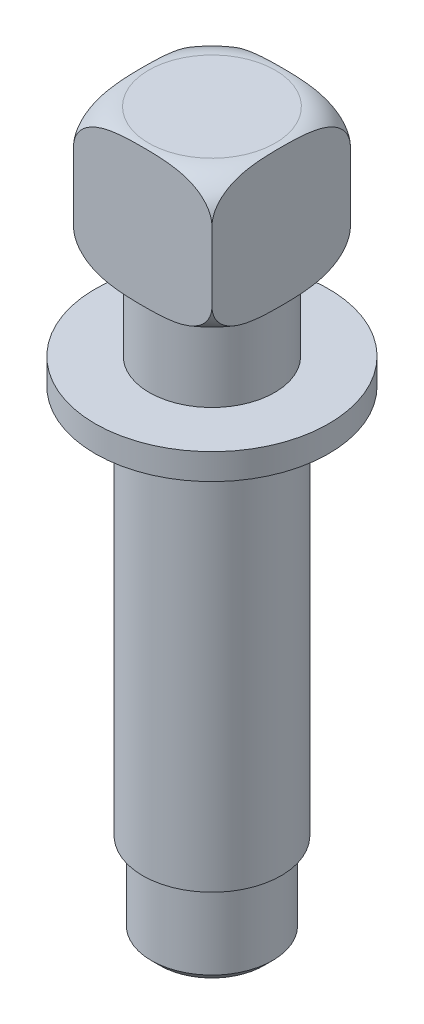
ISO-10303-21;
HEADER;
FILE_DESCRIPTION(('STEP AP214'),'2;1');
FILE_NAME('part.step','',(''),(''),'','','');
FILE_SCHEMA(('AUTOMOTIVE_DESIGN { 1 0 10303 214 1 1 1 1 }'));
ENDSEC;
DATA;
#1=APPLICATION_CONTEXT('core data for automotive mechanical design processes');
#2=APPLICATION_PROTOCOL_DEFINITION('international standard','automotive_design',2000,#1);
#3=PRODUCT_CONTEXT('',#1,'mechanical');
#4=PRODUCT('Part','Part','',(#3));
#5=PRODUCT_RELATED_PRODUCT_CATEGORY('part','',(#4));
#6=PRODUCT_DEFINITION_FORMATION('','',#4);
#7=PRODUCT_DEFINITION_CONTEXT('part definition',#1,'design');
#8=PRODUCT_DEFINITION('design','',#6,#7);
#9=PRODUCT_DEFINITION_SHAPE('','',#8);
#10=(LENGTH_UNIT() NAMED_UNIT(*) SI_UNIT(.MILLI.,.METRE.));
#11=(NAMED_UNIT(*) PLANE_ANGLE_UNIT() SI_UNIT($,.RADIAN.));
#12=(NAMED_UNIT(*) SI_UNIT($,.STERADIAN.) SOLID_ANGLE_UNIT());
#13=UNCERTAINTY_MEASURE_WITH_UNIT(LENGTH_MEASURE(1.E-05),#10,'distance_accuracy_value','');
#14=(GEOMETRIC_REPRESENTATION_CONTEXT(3) GLOBAL_UNCERTAINTY_ASSIGNED_CONTEXT((#13)) GLOBAL_UNIT_ASSIGNED_CONTEXT((#10,
#11,#12)) REPRESENTATION_CONTEXT('',''));
#15=CARTESIAN_POINT('',(0.,0.,0.));
#16=DIRECTION('',(0.,0.,1.));
#17=DIRECTION('',(1.,0.,0.));
#18=AXIS2_PLACEMENT_3D('',#15,#16,#17);
#19=CARTESIAN_POINT('',(-8.00000000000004,0.,8.00000000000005));
#20=DIRECTION('',(0.,1.,0.));
#21=DIRECTION('',(0.,0.,1.));
#22=AXIS2_PLACEMENT_3D('',#19,#20,#21);
#23=PLANE('',#22);
#24=CARTESIAN_POINT('',(0.,0.,0.));
#25=DIRECTION('',(0.,-1.,0.));
#26=DIRECTION('',(0.,0.,-1.));
#27=AXIS2_PLACEMENT_3D('',#24,#25,#26);
#28=CIRCLE('',#27,7.31370849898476);
#29=CARTESIAN_POINT('',(0.,0.,-7.31370849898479));
#30=VERTEX_POINT('',#29);
#31=EDGE_CURVE('E80',#30,#30,#28,.T.);
#32=ORIENTED_EDGE('',*,*,#31,.T.);
#33=EDGE_LOOP('',(#32));
#34=FACE_BOUND('',#33,.T.);
#35=CARTESIAN_POINT('',(0.,0.,0.));
#36=DIRECTION('',(0.,1.,0.));
#37=DIRECTION('',(0.,0.,1.));
#38=AXIS2_PLACEMENT_3D('',#35,#36,#37);
#39=CIRCLE('',#38,7.25);
#40=CARTESIAN_POINT('',(0.,0.,7.25000000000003));
#41=VERTEX_POINT('',#40);
#42=EDGE_CURVE('E103',#41,#41,#39,.F.);
#43=ORIENTED_EDGE('',*,*,#42,.F.);
#44=EDGE_LOOP('',(#43));
#45=FACE_BOUND('',#44,.T.);
#46=ADVANCED_FACE('F32',(#34,#45),#23,.F.);
#47=CARTESIAN_POINT('',(-8.00000000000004,16.,-8.00000000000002));
#48=DIRECTION('',(1.,0.,0.));
#49=DIRECTION('',(0.,0.,-1.));
#50=AXIS2_PLACEMENT_3D('',#47,#48,#49);
#51=PLANE('',#50);
#52=DIRECTION('',(0.,-1.,0.));
#53=VECTOR('',#52,1.);
#54=CARTESIAN_POINT('',(-8.00000000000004,16.,-8.00000000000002));
#55=LINE('',#54,#53);
#56=CARTESIAN_POINT('',(-8.00000000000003,12.,-8.00000000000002));
#57=VERTEX_POINT('',#56);
#58=CARTESIAN_POINT('',(-8.00000000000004,4.,-8.00000000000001));
#59=VERTEX_POINT('',#58);
#60=EDGE_CURVE('E93',#57,#59,#55,.T.);
#61=ORIENTED_EDGE('',*,*,#60,.T.);
#62=CARTESIAN_POINT('',(-8.00000000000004,0.0593142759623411,0.));
#63=CARTESIAN_POINT('',(-8.00000000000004,0.0593159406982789,0.146009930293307));
#64=CARTESIAN_POINT('',(-8.00000000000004,0.0600050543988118,0.292019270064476));
#65=CARTESIAN_POINT('',(-8.00000000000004,0.0628346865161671,0.584024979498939));
#66=CARTESIAN_POINT('',(-8.00000000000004,0.0649752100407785,0.730021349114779));
#67=CARTESIAN_POINT('',(-8.00000000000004,0.0709087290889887,1.02201317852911));
#68=CARTESIAN_POINT('',(-8.00000000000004,0.0747020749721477,1.16800863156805));
#69=CARTESIAN_POINT('',(-8.00000000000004,0.084280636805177,1.45993374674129));
#70=CARTESIAN_POINT('',(-8.00000000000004,0.0900658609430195,1.60586340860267));
#71=CARTESIAN_POINT('',(-8.00000000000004,0.111070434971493,2.0437594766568));
#72=CARTESIAN_POINT('',(-8.00000000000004,0.129934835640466,2.33557091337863));
#73=CARTESIAN_POINT('',(-8.00000000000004,0.182232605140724,2.91786522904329));
#74=CARTESIAN_POINT('',(-8.00000000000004,0.215659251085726,3.20834865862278));
#75=CARTESIAN_POINT('',(-8.00000000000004,0.286848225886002,3.67729775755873));
#76=CARTESIAN_POINT('',(-8.00000000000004,0.318224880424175,3.85670718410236));
#77=CARTESIAN_POINT('',(-8.00000000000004,0.390786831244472,4.21351623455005));
#78=CARTESIAN_POINT('',(-8.00000000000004,0.431973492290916,4.39091557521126));
#79=CARTESIAN_POINT('',(-8.00000000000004,0.572832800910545,4.91796281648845));
#80=CARTESIAN_POINT('',(-8.00000000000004,0.689937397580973,5.26347778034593));
#81=CARTESIAN_POINT('',(-8.00000000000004,0.938676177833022,5.82387591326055));
#82=CARTESIAN_POINT('',(-8.00000000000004,1.05429627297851,6.0458032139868));
#83=CARTESIAN_POINT('',(-8.00000000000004,1.31814010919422,6.4695740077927));
#84=CARTESIAN_POINT('',(-8.00000000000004,1.46632645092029,6.67144015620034));
#85=CARTESIAN_POINT('',(-8.00000000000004,1.76172393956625,7.00484591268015));
#86=CARTESIAN_POINT('',(-8.00000000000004,1.90231423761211,7.14217954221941));
#87=CARTESIAN_POINT('',(-8.00000000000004,2.12849924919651,7.32962718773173));
#88=CARTESIAN_POINT('',(-8.00000000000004,2.20647811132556,7.38903746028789));
#89=CARTESIAN_POINT('',(-8.00000000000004,2.36726291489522,7.50089012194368));
#90=CARTESIAN_POINT('',(-8.00000000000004,2.45006664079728,7.55333567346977));
#91=CARTESIAN_POINT('',(-8.00000000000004,2.62091433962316,7.65095039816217));
#92=CARTESIAN_POINT('',(-8.00000000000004,2.70900059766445,7.69604576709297));
#93=CARTESIAN_POINT('',(-8.00000000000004,2.88905240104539,7.7775679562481));
#94=CARTESIAN_POINT('',(-8.00000000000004,2.98101585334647,7.81399938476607));
#95=CARTESIAN_POINT('',(-8.00000000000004,3.16808517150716,7.87753184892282));
#96=CARTESIAN_POINT('',(-8.00000000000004,3.26318966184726,7.90463691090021));
#97=CARTESIAN_POINT('',(-8.00000000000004,3.45562897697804,7.94900156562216));
#98=CARTESIAN_POINT('',(-8.00000000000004,3.55296341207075,7.96626286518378));
#99=CARTESIAN_POINT('',(-8.00000000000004,3.81862250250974,7.99918644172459));
#100=CARTESIAN_POINT('',(-8.00000000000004,3.98827989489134,8.0050104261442));
#101=CARTESIAN_POINT('',(-8.00000000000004,4.32576428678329,7.98626783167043));
#102=CARTESIAN_POINT('',(-8.00000000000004,4.49359185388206,7.96171096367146));
#103=CARTESIAN_POINT('',(-8.00000000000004,4.8134084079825,7.88592128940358));
#104=CARTESIAN_POINT('',(-8.00000000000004,4.96576252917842,7.83621016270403));
#105=CARTESIAN_POINT('',(-8.00000000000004,5.26073866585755,7.71357922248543));
#106=CARTESIAN_POINT('',(-8.00000000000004,5.40336018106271,7.64065821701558));
#107=CARTESIAN_POINT('',(-8.00000000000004,5.68614140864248,7.46889709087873));
#108=CARTESIAN_POINT('',(-8.00000000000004,5.82539732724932,7.36857745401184));
#109=CARTESIAN_POINT('',(-8.00000000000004,6.08823525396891,7.14921042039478));
#110=CARTESIAN_POINT('',(-8.00000000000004,6.21180512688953,7.03014868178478));
#111=CARTESIAN_POINT('',(-8.00000000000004,6.50268458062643,6.71162048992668));
#112=CARTESIAN_POINT('',(-8.00000000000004,6.65942546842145,6.50248676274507));
#113=CARTESIAN_POINT('',(-8.00000000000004,6.9373527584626,6.06201799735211));
#114=CARTESIAN_POINT('',(-8.00000000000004,7.05848487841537,5.8306497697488));
#115=CARTESIAN_POINT('',(-8.00000000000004,7.24928919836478,5.40008777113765));
#116=CARTESIAN_POINT('',(-8.00000000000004,7.32437447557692,5.20322510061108));
#117=CARTESIAN_POINT('',(-8.00000000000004,7.45700349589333,4.80359765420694));
#118=CARTESIAN_POINT('',(-8.00000000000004,7.51453439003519,4.60082867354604));
#119=CARTESIAN_POINT('',(-8.00000000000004,7.61500962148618,4.19101798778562));
#120=CARTESIAN_POINT('',(-8.00000000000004,7.65790064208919,3.98396351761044));
#121=CARTESIAN_POINT('',(-8.00000000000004,7.7315784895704,3.56782736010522));
#122=CARTESIAN_POINT('',(-8.00000000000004,7.76236879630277,3.35874627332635));
#123=CARTESIAN_POINT('',(-8.00000000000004,7.81445248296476,2.93913559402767));
#124=CARTESIAN_POINT('',(-8.00000000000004,7.83573206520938,2.72860434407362));
#125=CARTESIAN_POINT('',(-8.00000000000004,7.87098833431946,2.30691591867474));
#126=CARTESIAN_POINT('',(-8.00000000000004,7.8849636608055,2.09575863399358));
#127=CARTESIAN_POINT('',(-8.00000000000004,7.90748614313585,1.67298690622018));
#128=CARTESIAN_POINT('',(-8.00000000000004,7.91602862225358,1.46137222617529));
#129=CARTESIAN_POINT('',(-8.00000000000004,7.92907683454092,1.0380403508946));
#130=CARTESIAN_POINT('',(-8.00000000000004,7.93358284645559,0.826323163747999));
#131=CARTESIAN_POINT('',(-8.00000000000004,7.93943311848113,0.402811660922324));
#132=CARTESIAN_POINT('',(-8.00000000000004,7.94077683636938,0.191017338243));
#133=CARTESIAN_POINT('',(-8.00000000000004,7.94058521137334,-0.23257730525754));
#134=CARTESIAN_POINT('',(-8.00000000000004,7.93904976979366,-0.444377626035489));
#135=CARTESIAN_POINT('',(-8.00000000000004,7.93277775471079,-0.867806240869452));
#136=CARTESIAN_POINT('',(-8.00000000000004,7.92804311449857,-1.07943456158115));
#137=CARTESIAN_POINT('',(-8.00000000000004,7.91446517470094,-1.50255244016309));
#138=CARTESIAN_POINT('',(-8.00000000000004,7.9056221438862,-1.71404200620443));
#139=CARTESIAN_POINT('',(-8.00000000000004,7.88181353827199,-2.14719722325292));
#140=CARTESIAN_POINT('',(-8.00000000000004,7.86656651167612,-2.36884827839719));
#141=CARTESIAN_POINT('',(-8.00000000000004,7.82775277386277,-2.81148823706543));
#142=CARTESIAN_POINT('',(-8.00000000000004,7.80418462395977,-3.03247701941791));
#143=CARTESIAN_POINT('',(-8.00000000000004,7.74611682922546,-3.47262050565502));
#144=CARTESIAN_POINT('',(-8.00000000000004,7.71163920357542,-3.69177799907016));
#145=CARTESIAN_POINT('',(-8.00000000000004,7.62874774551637,-4.12739608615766));
#146=CARTESIAN_POINT('',(-8.00000000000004,7.58033926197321,-4.34385768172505));
#147=CARTESIAN_POINT('',(-8.00000000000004,7.44413096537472,-4.85581578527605));
#148=CARTESIAN_POINT('',(-8.00000000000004,7.34833287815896,-5.14928782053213));
#149=CARTESIAN_POINT('',(-8.00000000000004,7.11457053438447,-5.71936801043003));
#150=CARTESIAN_POINT('',(-8.00000000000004,6.97665380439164,-5.99599475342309));
#151=CARTESIAN_POINT('',(-8.00000000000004,6.69796794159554,-6.44377207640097));
#152=CARTESIAN_POINT('',(-8.00000000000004,6.5693480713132,-6.62242795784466));
#153=CARTESIAN_POINT('',(-8.00000000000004,6.28550314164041,-6.95727656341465));
#154=CARTESIAN_POINT('',(-8.00000000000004,6.13031516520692,-7.11350004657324));
#155=CARTESIAN_POINT('',(-8.00000000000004,5.82373557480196,-7.37043309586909));
#156=CARTESIAN_POINT('',(-8.00000000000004,5.67649461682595,-7.47607404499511));
#157=CARTESIAN_POINT('',(-8.00000000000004,5.36645768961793,-7.6615901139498));
#158=CARTESIAN_POINT('',(-8.00000000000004,5.20366674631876,-7.74147352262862));
#159=CARTESIAN_POINT('',(-8.00000000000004,4.8652887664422,-7.87125409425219));
#160=CARTESIAN_POINT('',(-8.00000000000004,4.68963069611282,-7.92096812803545));
#161=CARTESIAN_POINT('',(-8.00000000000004,4.332068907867,-7.98625170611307));
#162=CARTESIAN_POINT('',(-8.00000000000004,4.15016827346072,-8.00183786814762));
#163=CARTESIAN_POINT('',(-8.00000000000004,3.80590411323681,-7.99802267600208));
#164=CARTESIAN_POINT('',(-8.00000000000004,3.6434915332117,-7.98211787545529));
#165=CARTESIAN_POINT('',(-8.00000000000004,3.32374770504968,-7.9230706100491));
#166=CARTESIAN_POINT('',(-8.00000000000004,3.16641577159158,-7.87993183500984));
#167=CARTESIAN_POINT('',(-8.00000000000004,2.86163909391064,-7.76903176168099));
#168=CARTESIAN_POINT('',(-8.00000000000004,2.71415023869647,-7.70139047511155));
#169=CARTESIAN_POINT('',(-8.00000000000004,2.43110443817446,-7.54466906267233));
#170=CARTESIAN_POINT('',(-8.00000000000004,2.29555135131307,-7.4555820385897));
#171=CARTESIAN_POINT('',(-8.00000000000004,2.02395836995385,-7.24870613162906));
#172=CARTESIAN_POINT('',(-8.00000000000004,1.88951163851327,-7.1288359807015));
#173=CARTESIAN_POINT('',(-8.00000000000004,1.63844711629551,-6.87183038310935));
#174=CARTESIAN_POINT('',(-8.00000000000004,1.52183747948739,-6.73468709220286));
#175=CARTESIAN_POINT('',(-8.00000000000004,1.23895347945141,-6.35766112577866));
#176=CARTESIAN_POINT('',(-8.00000000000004,1.08700707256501,-6.10700787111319));
#177=CARTESIAN_POINT('',(-8.00000000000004,0.824390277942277,-5.58498066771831));
#178=CARTESIAN_POINT('',(-8.00000000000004,0.713831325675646,-5.31355311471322));
#179=CARTESIAN_POINT('',(-8.00000000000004,0.515672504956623,-4.72606514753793));
#180=CARTESIAN_POINT('',(-8.00000000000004,0.432441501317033,-4.40856639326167));
#181=CARTESIAN_POINT('',(-8.00000000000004,0.33182446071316,-3.92736036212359));
#182=CARTESIAN_POINT('',(-8.00000000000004,0.302304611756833,-3.76595181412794));
#183=CARTESIAN_POINT('',(-8.00000000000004,0.250116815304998,-3.44202595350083));
#184=CARTESIAN_POINT('',(-8.00000000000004,0.227448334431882,-3.27950872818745));
#185=CARTESIAN_POINT('',(-8.00000000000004,0.187722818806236,-2.95322750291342));
#186=CARTESIAN_POINT('',(-8.00000000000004,0.170685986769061,-2.78946112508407));
#187=CARTESIAN_POINT('',(-8.00000000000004,0.141261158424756,-2.46152075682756));
#188=CARTESIAN_POINT('',(-8.00000000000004,0.128873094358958,-2.29734677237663));
#189=CARTESIAN_POINT('',(-8.00000000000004,0.107818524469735,-1.96888563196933));
#190=CARTESIAN_POINT('',(-8.00000000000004,0.0991493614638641,-1.80459864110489));
#191=CARTESIAN_POINT('',(-8.00000000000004,0.0847435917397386,-1.47590305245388));
#192=CARTESIAN_POINT('',(-8.00000000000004,0.0790069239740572,-1.31149445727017));
#193=CARTESIAN_POINT('',(-8.00000000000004,0.0717855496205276,-1.05141158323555));
#194=CARTESIAN_POINT('',(-8.00000000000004,0.0695260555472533,-0.955757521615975));
#195=CARTESIAN_POINT('',(-8.00000000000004,0.0657173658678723,-0.764435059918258));
#196=CARTESIAN_POINT('',(-8.00000000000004,0.0641681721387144,-0.66876665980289));
#197=CARTESIAN_POINT('',(-8.00000000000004,0.0604867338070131,-0.382073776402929));
#198=CARTESIAN_POINT('',(-8.00000000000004,0.059312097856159,-0.191036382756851));
#199=CARTESIAN_POINT('',(-8.00000000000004,0.0593142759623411,0.));
#200=B_SPLINE_CURVE_WITH_KNOTS('',3,(#62,#63,#64,#65,#66,#67,#68,#69,#70,#71,#72,#73,#74,#75,
#76,#77,#78,#79,#80,#81,#82,#83,#84,#85,#86,#87,#88,#89,#90,#91,#92,#93,#94,#95,#96,#97,#98,#99,
#100,#101,#102,#103,#104,#105,#106,#107,#108,#109,#110,#111,#112,#113,#114,#115,#116,#117,#118,
#119,#120,#121,#122,#123,#124,#125,#126,#127,#128,#129,#130,#131,#132,#133,#134,#135,#136,#137,
#138,#139,#140,#141,#142,#143,#144,#145,#146,#147,#148,#149,#150,#151,#152,#153,#154,#155,#156,
#157,#158,#159,#160,#161,#162,#163,#164,#165,#166,#167,#168,#169,#170,#171,#172,#173,#174,#175,
#176,#177,#178,#179,#180,#181,#182,#183,#184,#185,#186,#187,#188,#189,#190,#191,#192,#193,#194,
#195,#196,#197,#198,#199),.UNSPECIFIED.,.T.,.F.,(4,2,2,2,2,2,2,2,2,2,2,2,2,2,2,2,2,2,2,2,2,2,2,
2,2,2,2,2,2,2,2,2,2,2,2,2,2,2,2,2,2,2,2,2,2,2,2,2,2,2,2,2,2,2,2,2,2,2,2,2,2,2,2,2,2,2,2,2,4),
(0.,0.438026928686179,0.87605539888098,1.31417676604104,1.75229993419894,2.62933219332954,
3.50595998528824,4.05209238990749,4.59830081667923,5.68765549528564,6.43612020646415,
7.18372982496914,7.77083467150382,8.06461998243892,8.35827143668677,8.65471064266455,
8.9509918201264,9.24714492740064,9.54324666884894,10.0495983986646,10.5557883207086,
11.0344788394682,11.5131939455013,12.0261090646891,12.5394186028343,13.3190428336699,
14.0998494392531,14.7310249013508,15.3626612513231,15.9965739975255,16.6303043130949,
17.2649510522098,17.8997159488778,18.535026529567,19.1702932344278,19.8056688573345,
20.4410662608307,21.0760800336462,21.7110522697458,22.3774621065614,23.0439872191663,
23.7091755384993,24.3741087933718,25.2978042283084,26.2204611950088,26.8786470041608,
27.5359215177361,28.0773643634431,28.6186327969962,29.1631547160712,29.7074114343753,
30.194612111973,30.6817467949,31.1665270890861,31.6514635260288,32.1898506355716,
32.7284831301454,33.6027371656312,34.4793284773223,35.4614951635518,35.9536620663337,
36.4457906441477,36.939665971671,37.4335341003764,37.9270487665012,38.4205531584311,
38.7075930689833,38.9946337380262,39.5677391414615),.UNSPECIFIED.);
#201=CARTESIAN_POINT('',(-8.00000000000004,4.,8.00000000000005));
#202=VERTEX_POINT('',#201);
#203=EDGE_CURVE('E48',#59,#202,#200,.T.);
#204=ORIENTED_EDGE('',*,*,#203,.T.);
#205=DIRECTION('',(0.,-1.,0.));
#206=VECTOR('',#205,1.);
#207=CARTESIAN_POINT('',(-8.00000000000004,16.,8.00000000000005));
#208=LINE('',#207,#206);
#209=CARTESIAN_POINT('',(-8.00000000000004,12.,8.00000000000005));
#210=VERTEX_POINT('',#209);
#211=EDGE_CURVE('E95',#210,#202,#208,.T.);
#212=ORIENTED_EDGE('',*,*,#211,.F.);
#213=CARTESIAN_POINT('',(-8.00000009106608,15.9406858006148,0.));
#214=CARTESIAN_POINT('',(-8.0000000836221,15.9406841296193,-0.146009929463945));
#215=CARTESIAN_POINT('',(-8.00000002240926,15.9399949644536,-0.292019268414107));
#216=CARTESIAN_POINT('',(-7.99999997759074,15.9371652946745,-0.584024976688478));
#217=CARTESIAN_POINT('',(-7.99999999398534,15.9350247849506,-0.730021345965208));
#218=CARTESIAN_POINT('',(-8.00000000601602,15.9290912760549,-1.02201317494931));
#219=CARTESIAN_POINT('',(-8.00000000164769,15.9252979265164,-1.16800862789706));
#220=CARTESIAN_POINT('',(-7.99999999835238,15.9157193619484,-1.45993374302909));
#221=CARTESIAN_POINT('',(-7.99999999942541,15.9099341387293,-1.6058634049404));
#222=CARTESIAN_POINT('',(-8.00000000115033,15.8889295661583,-2.04375947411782));
#223=CARTESIAN_POINT('',(-8.00000000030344,15.8700651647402,-2.33557091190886));
#224=CARTESIAN_POINT('',(-7.99999999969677,15.8177673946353,-2.91786522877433));
#225=CARTESIAN_POINT('',(-7.99999999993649,15.7843407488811,-3.20834865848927));
#226=CARTESIAN_POINT('',(-8.00000000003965,15.7131517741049,-3.67729775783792));
#227=CARTESIAN_POINT('',(-8.00000000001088,15.6817751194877,-3.85670718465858));
#228=CARTESIAN_POINT('',(-7.9999999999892,15.6092131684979,-4.21351623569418));
#229=CARTESIAN_POINT('',(-7.99999999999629,15.5680265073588,-4.39091557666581));
#230=CARTESIAN_POINT('',(-8.00000000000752,15.427167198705,-4.91796281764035));
#231=CARTESIAN_POINT('',(-8.00000000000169,15.3100626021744,-5.26347778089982));
#232=CARTESIAN_POINT('',(-7.99999999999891,15.061323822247,-5.82387591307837));
#233=CARTESIAN_POINT('',(-7.99999999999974,14.9457037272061,-6.04580321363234));
#234=CARTESIAN_POINT('',(-8.00000000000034,14.6818598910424,-6.46957400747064));
#235=CARTESIAN_POINT('',(-8.00000000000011,14.5336735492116,-6.67144015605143));
#236=CARTESIAN_POINT('',(-7.99999999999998,14.2382760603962,-7.00484591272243));
#237=CARTESIAN_POINT('',(-8.00000000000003,14.0976857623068,-7.14217954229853));
#238=CARTESIAN_POINT('',(-8.00000000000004,13.8715007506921,-7.3296271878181));
#239=CARTESIAN_POINT('',(-8.00000000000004,13.7935218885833,-7.38903746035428));
#240=CARTESIAN_POINT('',(-8.00000000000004,13.6327370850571,-7.50089012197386));
#241=CARTESIAN_POINT('',(-8.00000000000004,13.5499333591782,-7.5533356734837));
#242=CARTESIAN_POINT('',(-8.00000000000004,13.3790856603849,-7.6509503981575));
#243=CARTESIAN_POINT('',(-8.00000000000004,13.2909994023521,-7.69604576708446));
#244=CARTESIAN_POINT('',(-8.00000000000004,13.1109475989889,-7.77756795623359));
#245=CARTESIAN_POINT('',(-8.00000000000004,13.0189841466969,-7.81399938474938));
#246=CARTESIAN_POINT('',(-8.00000000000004,12.8319148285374,-7.87753184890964));
#247=CARTESIAN_POINT('',(-8.00000000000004,12.7368103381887,-7.90463691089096));
#248=CARTESIAN_POINT('',(-8.00000000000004,12.5443710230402,-7.94900156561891));
#249=CARTESIAN_POINT('',(-8.00000000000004,12.4470365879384,-7.96626286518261));
#250=CARTESIAN_POINT('',(-8.00000000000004,12.181377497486,-7.99918644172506));
#251=CARTESIAN_POINT('',(-8.00000000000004,12.0117201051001,-8.00501042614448));
#252=CARTESIAN_POINT('',(-8.00000000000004,11.6742357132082,-7.98626783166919));
#253=CARTESIAN_POINT('',(-8.00000000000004,11.5064081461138,-7.96171096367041));
#254=CARTESIAN_POINT('',(-8.00000000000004,11.1865915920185,-7.88592128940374));
#255=CARTESIAN_POINT('',(-8.00000000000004,11.0342374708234,-7.83621016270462));
#256=CARTESIAN_POINT('',(-8.00000000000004,10.7392613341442,-7.71357922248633));
#257=CARTESIAN_POINT('',(-8.00000000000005,10.5966398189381,-7.64065821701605));
#258=CARTESIAN_POINT('',(-8.00000000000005,10.3138585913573,-7.46889709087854));
#259=CARTESIAN_POINT('',(-8.00000000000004,10.1746026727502,-7.3685774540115));
#260=CARTESIAN_POINT('',(-8.00000000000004,9.91176474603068,-7.14921042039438));
#261=CARTESIAN_POINT('',(-8.00000000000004,9.78819487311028,-7.03014868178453));
#262=CARTESIAN_POINT('',(-8.00000000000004,9.49731541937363,-6.71162048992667));
#263=CARTESIAN_POINT('',(-8.00000000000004,9.34057453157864,-6.50248676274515));
#264=CARTESIAN_POINT('',(-8.00000000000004,9.06264724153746,-6.06201799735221));
#265=CARTESIAN_POINT('',(-8.00000000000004,8.94151512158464,-5.83064976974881));
#266=CARTESIAN_POINT('',(-8.00000000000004,8.7507108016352,-5.40008777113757));
#267=CARTESIAN_POINT('',(-8.00000000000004,8.67562552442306,-5.203225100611));
#268=CARTESIAN_POINT('',(-8.00000000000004,8.54299650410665,-4.80359765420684));
#269=CARTESIAN_POINT('',(-8.00000000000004,8.48546560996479,-4.60082867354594));
#270=CARTESIAN_POINT('',(-8.00000000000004,8.38499037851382,-4.19101798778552));
#271=CARTESIAN_POINT('',(-8.00000000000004,8.34209935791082,-3.98396351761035));
#272=CARTESIAN_POINT('',(-8.00000000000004,8.2684215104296,-3.56782736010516));
#273=CARTESIAN_POINT('',(-8.00000000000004,8.23763120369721,-3.35874627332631));
#274=CARTESIAN_POINT('',(-8.00000000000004,8.18554751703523,-2.93913559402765));
#275=CARTESIAN_POINT('',(-8.00000000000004,8.16426793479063,-2.7286043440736));
#276=CARTESIAN_POINT('',(-8.00000000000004,8.12901166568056,-2.30691591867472));
#277=CARTESIAN_POINT('',(-8.00000000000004,8.11503633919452,-2.09575863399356));
#278=CARTESIAN_POINT('',(-8.00000000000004,8.09251385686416,-1.67298690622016));
#279=CARTESIAN_POINT('',(-8.00000000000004,8.08397137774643,-1.46137222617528));
#280=CARTESIAN_POINT('',(-8.00000000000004,8.0709231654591,-1.03804035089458));
#281=CARTESIAN_POINT('',(-8.00000000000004,8.06641715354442,-0.826323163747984));
#282=CARTESIAN_POINT('',(-8.00000000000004,8.06056688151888,-0.402811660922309));
#283=CARTESIAN_POINT('',(-8.00000000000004,8.05922316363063,-0.191017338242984));
#284=CARTESIAN_POINT('',(-8.00000000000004,8.05941478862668,0.232577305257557));
#285=CARTESIAN_POINT('',(-8.00000000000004,8.06095023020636,0.444377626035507));
#286=CARTESIAN_POINT('',(-8.00000000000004,8.06722224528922,0.867806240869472));
#287=CARTESIAN_POINT('',(-8.00000000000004,8.07195688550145,1.07943456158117));
#288=CARTESIAN_POINT('',(-8.00000000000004,8.08553482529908,1.5025524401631));
#289=CARTESIAN_POINT('',(-8.00000000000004,8.09437785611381,1.71404200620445));
#290=CARTESIAN_POINT('',(-8.00000000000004,8.11818646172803,2.14719722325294));
#291=CARTESIAN_POINT('',(-8.00000000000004,8.1334334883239,2.36884827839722));
#292=CARTESIAN_POINT('',(-8.00000000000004,8.17224722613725,2.81148823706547));
#293=CARTESIAN_POINT('',(-8.00000000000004,8.19581537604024,3.03247701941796));
#294=CARTESIAN_POINT('',(-8.00000000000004,8.25388317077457,3.47262050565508));
#295=CARTESIAN_POINT('',(-8.00000000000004,8.28836079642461,3.69177799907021));
#296=CARTESIAN_POINT('',(-8.00000000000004,8.37125225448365,4.12739608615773));
#297=CARTESIAN_POINT('',(-8.00000000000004,8.41966073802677,4.34385768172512));
#298=CARTESIAN_POINT('',(-8.00000000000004,8.55586903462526,4.85581578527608));
#299=CARTESIAN_POINT('',(-8.00000000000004,8.65166712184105,5.1492878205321));
#300=CARTESIAN_POINT('',(-8.00000000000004,8.88542946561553,5.71936801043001));
#301=CARTESIAN_POINT('',(-8.00000000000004,9.02334619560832,5.99599475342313));
#302=CARTESIAN_POINT('',(-8.00000000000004,9.30203205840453,6.44377207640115));
#303=CARTESIAN_POINT('',(-8.00000000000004,9.43065192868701,6.62242795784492));
#304=CARTESIAN_POINT('',(-8.00000000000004,9.71449685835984,6.9572765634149));
#305=CARTESIAN_POINT('',(-8.00000000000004,9.8696848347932,7.11350004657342));
#306=CARTESIAN_POINT('',(-8.00000000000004,10.1762644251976,7.3704330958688));
#307=CARTESIAN_POINT('',(-8.00000000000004,10.3235053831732,7.47607404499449));
#308=CARTESIAN_POINT('',(-8.00000000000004,10.6335423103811,7.66159011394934));
#309=CARTESIAN_POINT('',(-8.00000000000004,10.7963332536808,7.7414735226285));
#310=CARTESIAN_POINT('',(-8.00000000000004,11.1347112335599,7.87125409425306));
#311=CARTESIAN_POINT('',(-8.00000000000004,11.3103693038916,7.92096812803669));
#312=CARTESIAN_POINT('',(-8.00000000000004,11.6679310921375,7.98625170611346));
#313=CARTESIAN_POINT('',(-8.00000000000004,11.8498317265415,8.00183786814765));
#314=CARTESIAN_POINT('',(-8.00000000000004,12.194095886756,7.99802267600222));
#315=CARTESIAN_POINT('',(-8.00000000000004,12.3565084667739,7.98211787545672));
#316=CARTESIAN_POINT('',(-8.00000000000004,12.6762522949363,7.92307061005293));
#317=CARTESIAN_POINT('',(-8.00000000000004,12.8335842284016,7.87993183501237));
#318=CARTESIAN_POINT('',(-8.00000000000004,13.1383609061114,7.76903176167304));
#319=CARTESIAN_POINT('',(-8.00000000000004,13.2858497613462,7.70139047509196));
#320=CARTESIAN_POINT('',(-8.00000000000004,13.5688955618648,7.54466906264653));
#321=CARTESIAN_POINT('',(-8.00000000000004,13.7044486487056,7.45558203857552));
#322=CARTESIAN_POINT('',(-8.00000000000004,13.9760416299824,7.24870613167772));
#323=CARTESIAN_POINT('',(-8.00000000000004,14.1104883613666,7.12883598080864));
#324=CARTESIAN_POINT('',(-8.00000000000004,14.3615528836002,6.87183038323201));
#325=CARTESIAN_POINT('',(-8.00000000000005,14.4781625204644,6.73468709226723));
#326=CARTESIAN_POINT('',(-8.00000000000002,14.7610465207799,6.35766112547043));
#327=CARTESIAN_POINT('',(-7.99999999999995,14.9129929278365,6.10700787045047));
#328=CARTESIAN_POINT('',(-8.00000000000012,15.1756097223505,5.58498066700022));
#329=CARTESIAN_POINT('',(-8.00000000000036,15.2861686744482,5.31355311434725));
#330=CARTESIAN_POINT('',(-7.99999999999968,15.4843274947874,4.7260651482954));
#331=CARTESIAN_POINT('',(-7.99999999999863,15.5675584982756,4.40856639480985));
#332=CARTESIAN_POINT('',(-8.00000000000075,15.6681755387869,3.92736036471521));
#333=CARTESIAN_POINT('',(-8.00000000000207,15.6976953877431,3.76595181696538));
#334=CARTESIAN_POINT('',(-7.99999999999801,15.7498831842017,3.4420259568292));
#335=CARTESIAN_POINT('',(-7.99999999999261,15.7725516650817,3.27950873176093));
#336=CARTESIAN_POINT('',(-8.00000000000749,15.8122771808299,2.95322750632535));
#337=CARTESIAN_POINT('',(-8.00000000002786,15.8293140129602,2.78946112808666));
#338=CARTESIAN_POINT('',(-7.99999999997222,15.8587388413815,2.46152075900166));
#339=CARTESIAN_POINT('',(-7.99999999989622,15.8711269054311,2.29734677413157));
#340=CARTESIAN_POINT('',(-8.00000000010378,15.8921814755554,1.96888563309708));
#341=CARTESIAN_POINT('',(-8.00000000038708,15.9008506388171,1.8045986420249));
#342=CARTESIAN_POINT('',(-7.99999999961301,15.9152564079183,1.47590305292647));
#343=CARTESIAN_POINT('',(-7.99999999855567,15.9209930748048,1.31149445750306));
#344=CARTESIAN_POINT('',(-8.00000000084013,15.9282144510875,1.05141158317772));
#345=CARTESIAN_POINT('',(-8.00000000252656,15.9304739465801,0.955757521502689));
#346=CARTESIAN_POINT('',(-7.99999999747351,15.9342826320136,0.764435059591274));
#347=CARTESIAN_POINT('',(-7.99999999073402,15.935831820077,0.668766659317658));
#348=CARTESIAN_POINT('',(-8.00000001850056,15.9395132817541,0.382073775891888));
#349=CARTESIAN_POINT('',(-8.00000010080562,15.9406879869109,0.191036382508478));
#350=CARTESIAN_POINT('',(-8.00000009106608,15.9406858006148,0.));
#351=B_SPLINE_CURVE_WITH_KNOTS('',3,(#213,#214,#215,#216,#217,#218,#219,#220,#221,#222,#223,
#224,#225,#226,#227,#228,#229,#230,#231,#232,#233,#234,#235,#236,#237,#238,#239,#240,#241,#242,
#243,#244,#245,#246,#247,#248,#249,#250,#251,#252,#253,#254,#255,#256,#257,#258,#259,#260,#261,
#262,#263,#264,#265,#266,#267,#268,#269,#270,#271,#272,#273,#274,#275,#276,#277,#278,#279,#280,
#281,#282,#283,#284,#285,#286,#287,#288,#289,#290,#291,#292,#293,#294,#295,#296,#297,#298,#299,
#300,#301,#302,#303,#304,#305,#306,#307,#308,#309,#310,#311,#312,#313,#314,#315,#316,#317,#318,
#319,#320,#321,#322,#323,#324,#325,#326,#327,#328,#329,#330,#331,#332,#333,#334,#335,#336,#337,
#338,#339,#340,#341,#342,#343,#344,#345,#346,#347,#348,#349,#350),.UNSPECIFIED.,.T.,.F.,(4,2,2,
2,2,2,2,2,2,2,2,2,2,2,2,2,2,2,2,2,2,2,2,2,2,2,2,2,2,2,2,2,2,2,2,2,2,2,2,2,2,2,2,2,2,2,2,2,2,2,2,
2,2,2,2,2,2,2,2,2,2,2,2,2,2,2,2,2,4),(0.,0.438026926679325,0.876055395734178,1.31417676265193,
1.7522999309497,2.62933219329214,3.50595998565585,4.05209239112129,4.59830081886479,
5.68765549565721,6.43612020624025,7.18372982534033,7.77083467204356,8.06461998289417,
8.35827143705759,8.65471064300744,8.95099182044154,9.2471449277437,9.54324666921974,
10.0495983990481,10.5557883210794,11.034478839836,11.5131939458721,12.0261090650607,
12.5394186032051,13.3190428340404,14.0998494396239,14.7310249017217,15.362661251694,
15.9965739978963,16.6303043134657,17.2649510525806,17.8997159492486,18.5350265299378,
19.1702932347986,19.8056688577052,20.4410662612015,21.076080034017,21.7110522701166,
22.3774621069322,23.0439872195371,23.7091755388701,24.3741087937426,25.2978042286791,
26.2204611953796,26.878647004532,27.535921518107,28.0773643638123,28.618632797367,
29.1631547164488,29.707411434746,30.1946121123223,30.6817467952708,31.1665270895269,
31.6514635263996,32.1898506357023,32.7284831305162,33.602737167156,34.4793284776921,
35.4614951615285,35.9536620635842,36.4457906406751,36.9396659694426,37.4335340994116,
37.9270487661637,38.4205531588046,38.707593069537,38.9946337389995,39.5677391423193),.UNSPECIFIED.);
#352=EDGE_CURVE('E97',#210,#57,#351,.T.);
#353=ORIENTED_EDGE('',*,*,#352,.T.);
#354=EDGE_LOOP('',(#61,#204,#212,#353));
#355=FACE_BOUND('',#354,.T.);
#356=ADVANCED_FACE('F34',(#355),#51,.F.);
#357=CARTESIAN_POINT('',(-8.00000000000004,16.,8.00000000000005));
#358=DIRECTION('',(0.,0.,-1.));
#359=DIRECTION('',(-1.,0.,0.));
#360=AXIS2_PLACEMENT_3D('',#357,#358,#359);
#361=PLANE('',#360);
#362=ORIENTED_EDGE('',*,*,#211,.T.);
#363=CARTESIAN_POINT('',(0.,0.0593142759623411,8.00000000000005));
#364=CARTESIAN_POINT('',(0.146009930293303,0.0593159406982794,8.00000000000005));
#365=CARTESIAN_POINT('',(0.292019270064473,0.0600050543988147,8.00000000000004));
#366=CARTESIAN_POINT('',(0.584024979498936,0.0628346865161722,8.00000000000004));
#367=CARTESIAN_POINT('',(0.730021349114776,0.0649752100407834,8.00000000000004));
#368=CARTESIAN_POINT('',(1.02201317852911,0.0709087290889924,8.00000000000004));
#369=CARTESIAN_POINT('',(1.16800863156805,0.0747020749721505,8.00000000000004));
#370=CARTESIAN_POINT('',(1.45993374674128,0.0842806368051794,8.00000000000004));
#371=CARTESIAN_POINT('',(1.60586340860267,0.0900658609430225,8.00000000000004));
#372=CARTESIAN_POINT('',(2.04375947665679,0.111070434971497,8.00000000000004));
#373=CARTESIAN_POINT('',(2.33557091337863,0.129934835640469,8.00000000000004));
#374=CARTESIAN_POINT('',(2.91786522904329,0.182232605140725,8.00000000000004));
#375=CARTESIAN_POINT('',(3.20834865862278,0.215659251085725,8.00000000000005));
#376=CARTESIAN_POINT('',(3.67729775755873,0.286848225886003,8.00000000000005));
#377=CARTESIAN_POINT('',(3.85670718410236,0.318224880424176,8.00000000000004));
#378=CARTESIAN_POINT('',(4.21351623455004,0.390786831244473,8.00000000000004));
#379=CARTESIAN_POINT('',(4.39091557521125,0.431973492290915,8.00000000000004));
#380=CARTESIAN_POINT('',(4.91796281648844,0.572832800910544,8.00000000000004));
#381=CARTESIAN_POINT('',(5.26347778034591,0.689937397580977,8.00000000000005));
#382=CARTESIAN_POINT('',(5.82387591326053,0.938676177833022,8.00000000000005));
#383=CARTESIAN_POINT('',(6.04580321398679,1.05429627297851,8.00000000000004));
#384=CARTESIAN_POINT('',(6.46957400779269,1.31814010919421,8.00000000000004));
#385=CARTESIAN_POINT('',(6.67144015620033,1.46632645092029,8.00000000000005));
#386=CARTESIAN_POINT('',(7.00484591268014,1.76172393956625,8.00000000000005));
#387=CARTESIAN_POINT('',(7.14217954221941,1.90231423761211,8.00000000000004));
#388=CARTESIAN_POINT('',(7.32962718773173,2.12849924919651,8.00000000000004));
#389=CARTESIAN_POINT('',(7.38903746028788,2.20647811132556,8.00000000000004));
#390=CARTESIAN_POINT('',(7.50089012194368,2.36726291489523,8.00000000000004));
#391=CARTESIAN_POINT('',(7.55333567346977,2.45006664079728,8.00000000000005));
#392=CARTESIAN_POINT('',(7.65095039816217,2.62091433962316,8.00000000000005));
#393=CARTESIAN_POINT('',(7.69604576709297,2.70900059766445,8.00000000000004));
#394=CARTESIAN_POINT('',(7.77756795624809,2.88905240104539,8.00000000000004));
#395=CARTESIAN_POINT('',(7.81399938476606,2.98101585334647,8.00000000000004));
#396=CARTESIAN_POINT('',(7.87753184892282,3.16808517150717,8.00000000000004));
#397=CARTESIAN_POINT('',(7.90463691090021,3.26318966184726,8.00000000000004));
#398=CARTESIAN_POINT('',(7.94900156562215,3.45562897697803,8.00000000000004));
#399=CARTESIAN_POINT('',(7.96626286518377,3.55296341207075,8.00000000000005));
#400=CARTESIAN_POINT('',(7.99918644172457,3.81862250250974,8.00000000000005));
#401=CARTESIAN_POINT('',(8.00501042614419,3.98827989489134,8.00000000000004));
#402=CARTESIAN_POINT('',(7.98626783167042,4.32576428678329,8.00000000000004));
#403=CARTESIAN_POINT('',(7.96171096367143,4.49359185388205,8.00000000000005));
#404=CARTESIAN_POINT('',(7.88592128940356,4.8134084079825,8.00000000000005));
#405=CARTESIAN_POINT('',(7.83621016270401,4.96576252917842,8.00000000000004));
#406=CARTESIAN_POINT('',(7.71357922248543,5.26073866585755,8.00000000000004));
#407=CARTESIAN_POINT('',(7.64065821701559,5.40336018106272,8.00000000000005));
#408=CARTESIAN_POINT('',(7.46889709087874,5.68614140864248,8.00000000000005));
#409=CARTESIAN_POINT('',(7.36857745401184,5.82539732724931,8.00000000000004));
#410=CARTESIAN_POINT('',(7.14921042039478,6.08823525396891,8.00000000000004));
#411=CARTESIAN_POINT('',(7.03014868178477,6.21180512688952,8.00000000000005));
#412=CARTESIAN_POINT('',(6.71162048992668,6.50268458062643,8.00000000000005));
#413=CARTESIAN_POINT('',(6.50248676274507,6.65942546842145,8.00000000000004));
#414=CARTESIAN_POINT('',(6.0620179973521,6.93735275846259,8.00000000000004));
#415=CARTESIAN_POINT('',(5.83064976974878,7.05848487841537,8.00000000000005));
#416=CARTESIAN_POINT('',(5.40008777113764,7.24928919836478,8.00000000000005));
#417=CARTESIAN_POINT('',(5.20322510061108,7.32437447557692,8.00000000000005));
#418=CARTESIAN_POINT('',(4.80359765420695,7.45700349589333,8.00000000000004));
#419=CARTESIAN_POINT('',(4.60082867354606,7.51453439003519,8.00000000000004));
#420=CARTESIAN_POINT('',(4.19101798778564,7.61500962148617,8.00000000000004));
#421=CARTESIAN_POINT('',(3.98396351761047,7.65790064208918,8.00000000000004));
#422=CARTESIAN_POINT('',(3.56782736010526,7.7315784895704,8.00000000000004));
#423=CARTESIAN_POINT('',(3.3587462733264,7.76236879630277,8.00000000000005));
#424=CARTESIAN_POINT('',(2.93913559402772,7.81445248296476,8.00000000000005));
#425=CARTESIAN_POINT('',(2.72860434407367,7.83573206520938,8.00000000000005));
#426=CARTESIAN_POINT('',(2.30691591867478,7.87098833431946,8.00000000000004));
#427=CARTESIAN_POINT('',(2.09575863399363,7.8849636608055,8.00000000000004));
#428=CARTESIAN_POINT('',(1.67298690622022,7.90748614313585,8.00000000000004));
#429=CARTESIAN_POINT('',(1.46137222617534,7.91602862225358,8.00000000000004));
#430=CARTESIAN_POINT('',(1.03804035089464,7.92907683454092,8.00000000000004));
#431=CARTESIAN_POINT('',(0.826323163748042,7.93358284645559,8.00000000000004));
#432=CARTESIAN_POINT('',(0.402811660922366,7.93943311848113,8.00000000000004));
#433=CARTESIAN_POINT('',(0.191017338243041,7.94077683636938,8.00000000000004));
#434=CARTESIAN_POINT('',(-0.2325773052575,7.94058521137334,8.00000000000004));
#435=CARTESIAN_POINT('',(-0.444377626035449,7.93904976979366,8.00000000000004));
#436=CARTESIAN_POINT('',(-0.867806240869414,7.93277775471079,8.00000000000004));
#437=CARTESIAN_POINT('',(-1.07943456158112,7.92804311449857,8.00000000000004));
#438=CARTESIAN_POINT('',(-1.50255244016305,7.91446517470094,8.00000000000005));
#439=CARTESIAN_POINT('',(-1.71404200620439,7.9056221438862,8.00000000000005));
#440=CARTESIAN_POINT('',(-2.14719722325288,7.88181353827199,8.00000000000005));
#441=CARTESIAN_POINT('',(-2.36884827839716,7.86656651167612,8.00000000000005));
#442=CARTESIAN_POINT('',(-2.81148823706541,7.82775277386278,8.00000000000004));
#443=CARTESIAN_POINT('',(-3.03247701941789,7.80418462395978,8.00000000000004));
#444=CARTESIAN_POINT('',(-3.47262050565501,7.74611682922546,8.00000000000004));
#445=CARTESIAN_POINT('',(-3.69177799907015,7.71163920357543,8.00000000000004));
#446=CARTESIAN_POINT('',(-4.12739608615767,7.62874774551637,8.00000000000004));
#447=CARTESIAN_POINT('',(-4.34385768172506,7.58033926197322,8.00000000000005));
#448=CARTESIAN_POINT('',(-4.85581578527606,7.44413096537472,8.00000000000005));
#449=CARTESIAN_POINT('',(-5.14928782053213,7.34833287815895,8.00000000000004));
#450=CARTESIAN_POINT('',(-5.71936801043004,7.11457053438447,8.00000000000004));
#451=CARTESIAN_POINT('',(-5.99599475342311,6.97665380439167,8.00000000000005));
#452=CARTESIAN_POINT('',(-6.44377207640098,6.69796794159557,8.00000000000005));
#453=CARTESIAN_POINT('',(-6.62242795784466,6.5693480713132,8.00000000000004));
#454=CARTESIAN_POINT('',(-6.95727656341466,6.2855031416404,8.00000000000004));
#455=CARTESIAN_POINT('',(-7.11350004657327,6.13031516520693,8.00000000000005));
#456=CARTESIAN_POINT('',(-7.37043309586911,5.82373557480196,8.00000000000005));
#457=CARTESIAN_POINT('',(-7.47607404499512,5.67649461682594,8.00000000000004));
#458=CARTESIAN_POINT('',(-7.66159011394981,5.36645768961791,8.00000000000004));
#459=CARTESIAN_POINT('',(-7.74147352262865,5.20366674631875,8.00000000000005));
#460=CARTESIAN_POINT('',(-7.87125409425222,4.86528876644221,8.00000000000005));
#461=CARTESIAN_POINT('',(-7.92096812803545,4.68963069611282,8.00000000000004));
#462=CARTESIAN_POINT('',(-7.98625170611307,4.33206890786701,8.00000000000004));
#463=CARTESIAN_POINT('',(-8.00183786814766,4.15016827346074,8.00000000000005));
#464=CARTESIAN_POINT('',(-7.99802267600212,3.80590411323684,8.00000000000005));
#465=CARTESIAN_POINT('',(-7.98211787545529,3.64349153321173,8.00000000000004));
#466=CARTESIAN_POINT('',(-7.9230706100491,3.3237477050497,8.00000000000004));
#467=CARTESIAN_POINT('',(-7.87993183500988,3.16641577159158,8.00000000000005));
#468=CARTESIAN_POINT('',(-7.76903176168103,2.86163909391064,8.00000000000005));
#469=CARTESIAN_POINT('',(-7.70139047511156,2.71415023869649,8.00000000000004));
#470=CARTESIAN_POINT('',(-7.54466906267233,2.43110443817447,8.00000000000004));
#471=CARTESIAN_POINT('',(-7.45558203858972,2.29555135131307,8.00000000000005));
#472=CARTESIAN_POINT('',(-7.24870613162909,2.02395836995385,8.00000000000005));
#473=CARTESIAN_POINT('',(-7.12883598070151,1.88951163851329,8.00000000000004));
#474=CARTESIAN_POINT('',(-6.87183038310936,1.63844711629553,8.00000000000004));
#475=CARTESIAN_POINT('',(-6.73468709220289,1.52183747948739,8.00000000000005));
#476=CARTESIAN_POINT('',(-6.35766112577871,1.2389534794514,8.00000000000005));
#477=CARTESIAN_POINT('',(-6.10700787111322,1.08700707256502,8.00000000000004));
#478=CARTESIAN_POINT('',(-5.58498066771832,0.824390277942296,8.00000000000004));
#479=CARTESIAN_POINT('',(-5.31355311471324,0.71383132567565,8.00000000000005));
#480=CARTESIAN_POINT('',(-4.72606514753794,0.515672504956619,8.00000000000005));
#481=CARTESIAN_POINT('',(-4.40856639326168,0.432441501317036,8.00000000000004));
#482=CARTESIAN_POINT('',(-3.9273603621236,0.331824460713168,8.00000000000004));
#483=CARTESIAN_POINT('',(-3.76595181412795,0.302304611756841,8.00000000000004));
#484=CARTESIAN_POINT('',(-3.44202595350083,0.250116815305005,8.00000000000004));
#485=CARTESIAN_POINT('',(-3.27950872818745,0.227448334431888,8.00000000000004));
#486=CARTESIAN_POINT('',(-2.95322750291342,0.18772281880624,8.00000000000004));
#487=CARTESIAN_POINT('',(-2.78946112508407,0.170685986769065,8.00000000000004));
#488=CARTESIAN_POINT('',(-2.46152075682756,0.141261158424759,8.00000000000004));
#489=CARTESIAN_POINT('',(-2.29734677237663,0.128873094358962,8.00000000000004));
#490=CARTESIAN_POINT('',(-1.96888563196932,0.107818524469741,8.00000000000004));
#491=CARTESIAN_POINT('',(-1.80459864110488,0.0991493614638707,8.00000000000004));
#492=CARTESIAN_POINT('',(-1.47590305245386,0.0847435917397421,8.00000000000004));
#493=CARTESIAN_POINT('',(-1.31149445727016,0.0790069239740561,8.00000000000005));
#494=CARTESIAN_POINT('',(-1.05141158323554,0.0717855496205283,8.00000000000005));
#495=CARTESIAN_POINT('',(-0.95575752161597,0.0695260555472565,8.00000000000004));
#496=CARTESIAN_POINT('',(-0.764435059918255,0.0657173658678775,8.00000000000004));
#497=CARTESIAN_POINT('',(-0.668766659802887,0.0641681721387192,8.00000000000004));
#498=CARTESIAN_POINT('',(-0.382073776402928,0.0604867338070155,8.00000000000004));
#499=CARTESIAN_POINT('',(-0.191036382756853,0.0593120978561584,8.00000000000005));
#500=CARTESIAN_POINT('',(0.,0.0593142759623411,8.00000000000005));
#501=B_SPLINE_CURVE_WITH_KNOTS('',3,(#363,#364,#365,#366,#367,#368,#369,#370,#371,#372,#373,
#374,#375,#376,#377,#378,#379,#380,#381,#382,#383,#384,#385,#386,#387,#388,#389,#390,#391,#392,
#393,#394,#395,#396,#397,#398,#399,#400,#401,#402,#403,#404,#405,#406,#407,#408,#409,#410,#411,
#412,#413,#414,#415,#416,#417,#418,#419,#420,#421,#422,#423,#424,#425,#426,#427,#428,#429,#430,
#431,#432,#433,#434,#435,#436,#437,#438,#439,#440,#441,#442,#443,#444,#445,#446,#447,#448,#449,
#450,#451,#452,#453,#454,#455,#456,#457,#458,#459,#460,#461,#462,#463,#464,#465,#466,#467,#468,
#469,#470,#471,#472,#473,#474,#475,#476,#477,#478,#479,#480,#481,#482,#483,#484,#485,#486,#487,
#488,#489,#490,#491,#492,#493,#494,#495,#496,#497,#498,#499,#500),.UNSPECIFIED.,.T.,.F.,(4,2,2,
2,2,2,2,2,2,2,2,2,2,2,2,2,2,2,2,2,2,2,2,2,2,2,2,2,2,2,2,2,2,2,2,2,2,2,2,2,2,2,2,2,2,2,2,2,2,2,2,
2,2,2,2,2,2,2,2,2,2,2,2,2,2,2,2,2,4),(0.,0.43802692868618,0.876055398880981,1.31417676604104,
1.75229993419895,2.62933219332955,3.50595998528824,4.05209238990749,4.59830081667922,
5.68765549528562,6.43612020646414,7.18372982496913,7.77083467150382,8.06461998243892,
8.35827143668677,8.65471064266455,8.95099182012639,9.24714492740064,9.54324666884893,
10.0495983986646,10.5557883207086,11.0344788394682,11.5131939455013,12.0261090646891,
12.5394186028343,13.3190428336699,14.0998494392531,14.7310249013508,15.3626612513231,
15.9965739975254,16.6303043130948,17.2649510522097,17.8997159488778,18.535026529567,
19.1702932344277,19.8056688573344,20.4410662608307,21.0760800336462,21.7110522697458,
22.3774621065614,23.0439872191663,23.7091755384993,24.3741087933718,25.2978042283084,
26.2204611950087,26.8786470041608,27.5359215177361,28.0773643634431,28.6186327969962,
29.1631547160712,29.7074114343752,30.194612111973,30.6817467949,31.1665270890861,
31.6514635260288,32.1898506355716,32.7284831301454,33.6027371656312,34.4793284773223,
35.4614951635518,35.9536620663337,36.4457906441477,36.939665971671,37.4335341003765,
37.9270487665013,38.4205531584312,38.7075930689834,38.9946337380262,39.5677391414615),.UNSPECIFIED.);
#502=CARTESIAN_POINT('',(8.00000000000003,4.,8.00000000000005));
#503=VERTEX_POINT('',#502);
#504=EDGE_CURVE('E89',#202,#503,#501,.T.);
#505=ORIENTED_EDGE('',*,*,#504,.T.);
#506=DIRECTION('',(0.,-1.,0.));
#507=VECTOR('',#506,1.);
#508=CARTESIAN_POINT('',(8.00000000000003,16.,8.00000000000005));
#509=LINE('',#508,#507);
#510=CARTESIAN_POINT('',(8.00000000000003,12.,8.00000000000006));
#511=VERTEX_POINT('',#510);
#512=EDGE_CURVE('E88',#511,#503,#509,.T.);
#513=ORIENTED_EDGE('',*,*,#512,.F.);
#514=CARTESIAN_POINT('',(0.,15.9406857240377,8.00000000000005));
#515=CARTESIAN_POINT('',(-0.14600993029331,15.9406840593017,8.00000000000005));
#516=CARTESIAN_POINT('',(-0.29201927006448,15.9399949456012,8.00000000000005));
#517=CARTESIAN_POINT('',(-0.584024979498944,15.9371653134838,8.00000000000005));
#518=CARTESIAN_POINT('',(-0.730021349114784,15.9350247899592,8.00000000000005));
#519=CARTESIAN_POINT('',(-1.02201317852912,15.929091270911,8.00000000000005));
#520=CARTESIAN_POINT('',(-1.16800863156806,15.9252979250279,8.00000000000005));
#521=CARTESIAN_POINT('',(-1.45993374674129,15.9157193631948,8.00000000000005));
#522=CARTESIAN_POINT('',(-1.60586340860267,15.909934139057,8.00000000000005));
#523=CARTESIAN_POINT('',(-2.0437594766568,15.8889295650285,8.00000000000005));
#524=CARTESIAN_POINT('',(-2.33557091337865,15.8700651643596,8.00000000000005));
#525=CARTESIAN_POINT('',(-2.9178652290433,15.8177673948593,8.00000000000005));
#526=CARTESIAN_POINT('',(-3.20834865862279,15.7843407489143,8.00000000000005));
#527=CARTESIAN_POINT('',(-3.67729775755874,15.713151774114,8.00000000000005));
#528=CARTESIAN_POINT('',(-3.85670718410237,15.6817751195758,8.00000000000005));
#529=CARTESIAN_POINT('',(-4.21351623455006,15.6092131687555,8.00000000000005));
#530=CARTESIAN_POINT('',(-4.39091557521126,15.5680265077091,8.00000000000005));
#531=CARTESIAN_POINT('',(-4.91796281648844,15.4271671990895,8.00000000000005));
#532=CARTESIAN_POINT('',(-5.2634777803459,15.310062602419,8.00000000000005));
#533=CARTESIAN_POINT('',(-5.82387591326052,15.061323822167,8.00000000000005));
#534=CARTESIAN_POINT('',(-6.04580321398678,14.9457037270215,8.00000000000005));
#535=CARTESIAN_POINT('',(-6.46957400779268,14.6818598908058,8.00000000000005));
#536=CARTESIAN_POINT('',(-6.67144015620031,14.5336735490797,8.00000000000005));
#537=CARTESIAN_POINT('',(-7.00484591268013,14.2382760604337,8.00000000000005));
#538=CARTESIAN_POINT('',(-7.1421795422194,14.0976857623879,8.00000000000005));
#539=CARTESIAN_POINT('',(-7.32962718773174,13.8715007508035,8.00000000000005));
#540=CARTESIAN_POINT('',(-7.38903746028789,13.7935218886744,8.00000000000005));
#541=CARTESIAN_POINT('',(-7.50089012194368,13.6327370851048,8.00000000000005));
#542=CARTESIAN_POINT('',(-7.55333567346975,13.5499333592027,8.00000000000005));
#543=CARTESIAN_POINT('',(-7.65095039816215,13.3790856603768,8.00000000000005));
#544=CARTESIAN_POINT('',(-7.69604576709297,13.2909994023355,8.00000000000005));
#545=CARTESIAN_POINT('',(-7.77756795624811,13.1109475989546,8.00000000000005));
#546=CARTESIAN_POINT('',(-7.81399938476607,13.0189841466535,8.00000000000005));
#547=CARTESIAN_POINT('',(-7.87753184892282,12.8319148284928,8.00000000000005));
#548=CARTESIAN_POINT('',(-7.90463691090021,12.7368103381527,8.00000000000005));
#549=CARTESIAN_POINT('',(-7.94900156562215,12.544371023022,8.00000000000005));
#550=CARTESIAN_POINT('',(-7.96626286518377,12.4470365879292,8.00000000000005));
#551=CARTESIAN_POINT('',(-7.99918644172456,12.1813774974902,8.00000000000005));
#552=CARTESIAN_POINT('',(-8.00501042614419,12.0117201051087,8.00000000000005));
#553=CARTESIAN_POINT('',(-7.98626783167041,11.6742357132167,8.00000000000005));
#554=CARTESIAN_POINT('',(-7.96171096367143,11.506408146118,8.00000000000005));
#555=CARTESIAN_POINT('',(-7.88592128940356,11.1865915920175,8.00000000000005));
#556=CARTESIAN_POINT('',(-7.836210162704,11.0342374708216,8.00000000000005));
#557=CARTESIAN_POINT('',(-7.71357922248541,10.7392613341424,8.00000000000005));
#558=CARTESIAN_POINT('',(-7.64065821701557,10.5966398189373,8.00000000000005));
#559=CARTESIAN_POINT('',(-7.46889709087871,10.3138585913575,8.00000000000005));
#560=CARTESIAN_POINT('',(-7.36857745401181,10.1746026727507,8.00000000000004));
#561=CARTESIAN_POINT('',(-7.14921042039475,9.91176474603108,8.00000000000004));
#562=CARTESIAN_POINT('',(-7.03014868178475,9.78819487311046,8.00000000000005));
#563=CARTESIAN_POINT('',(-6.71162048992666,9.49731541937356,8.00000000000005));
#564=CARTESIAN_POINT('',(-6.50248676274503,9.34057453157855,8.00000000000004));
#565=CARTESIAN_POINT('',(-6.06201799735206,9.0626472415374,8.00000000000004));
#566=CARTESIAN_POINT('',(-5.83064976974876,8.94151512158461,8.00000000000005));
#567=CARTESIAN_POINT('',(-5.40008777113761,8.75071080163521,8.00000000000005));
#568=CARTESIAN_POINT('',(-5.20322510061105,8.67562552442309,8.00000000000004));
#569=CARTESIAN_POINT('',(-4.80359765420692,8.54299650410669,8.00000000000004));
#570=CARTESIAN_POINT('',(-4.60082867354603,8.48546560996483,8.00000000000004));
#571=CARTESIAN_POINT('',(-4.19101798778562,8.38499037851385,8.00000000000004));
#572=CARTESIAN_POINT('',(-3.98396351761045,8.34209935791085,8.00000000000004));
#573=CARTESIAN_POINT('',(-3.56782736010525,8.26842151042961,8.00000000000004));
#574=CARTESIAN_POINT('',(-3.35874627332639,8.23763120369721,8.00000000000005));
#575=CARTESIAN_POINT('',(-2.93913559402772,8.18554751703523,8.00000000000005));
#576=CARTESIAN_POINT('',(-2.72860434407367,8.16426793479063,8.00000000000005));
#577=CARTESIAN_POINT('',(-2.30691591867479,8.12901166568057,8.00000000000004));
#578=CARTESIAN_POINT('',(-2.09575863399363,8.11503633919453,8.00000000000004));
#579=CARTESIAN_POINT('',(-1.67298690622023,8.09251385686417,8.00000000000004));
#580=CARTESIAN_POINT('',(-1.46137222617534,8.08397137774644,8.00000000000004));
#581=CARTESIAN_POINT('',(-1.03804035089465,8.0709231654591,8.00000000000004));
#582=CARTESIAN_POINT('',(-0.826323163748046,8.06641715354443,8.00000000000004));
#583=CARTESIAN_POINT('',(-0.40281166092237,8.06056688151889,8.00000000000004));
#584=CARTESIAN_POINT('',(-0.191017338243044,8.05922316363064,8.00000000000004));
#585=CARTESIAN_POINT('',(0.232577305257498,8.05941478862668,8.00000000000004));
#586=CARTESIAN_POINT('',(0.444377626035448,8.06095023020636,8.00000000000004));
#587=CARTESIAN_POINT('',(0.867806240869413,8.06722224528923,8.00000000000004));
#588=CARTESIAN_POINT('',(1.07943456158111,8.07195688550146,8.00000000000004));
#589=CARTESIAN_POINT('',(1.50255244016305,8.08553482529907,8.00000000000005));
#590=CARTESIAN_POINT('',(1.71404200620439,8.09437785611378,8.00000000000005));
#591=CARTESIAN_POINT('',(2.14719722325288,8.118186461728,8.00000000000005));
#592=CARTESIAN_POINT('',(2.36884827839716,8.13343348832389,8.00000000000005));
#593=CARTESIAN_POINT('',(2.81148823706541,8.17224722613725,8.00000000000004));
#594=CARTESIAN_POINT('',(3.0324770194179,8.19581537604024,8.00000000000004));
#595=CARTESIAN_POINT('',(3.47262050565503,8.25388317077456,8.00000000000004));
#596=CARTESIAN_POINT('',(3.69177799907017,8.2883607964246,8.00000000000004));
#597=CARTESIAN_POINT('',(4.12739608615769,8.37125225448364,8.00000000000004));
#598=CARTESIAN_POINT('',(4.34385768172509,8.41966073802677,8.00000000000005));
#599=CARTESIAN_POINT('',(4.85581578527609,8.55586903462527,8.00000000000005));
#600=CARTESIAN_POINT('',(5.14928782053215,8.65166712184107,8.00000000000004));
#601=CARTESIAN_POINT('',(5.71936801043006,8.88542946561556,8.00000000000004));
#602=CARTESIAN_POINT('',(5.99599475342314,9.02334619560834,8.00000000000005));
#603=CARTESIAN_POINT('',(6.443772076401,9.30203205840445,8.00000000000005));
#604=CARTESIAN_POINT('',(6.62242795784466,9.43065192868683,8.00000000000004));
#605=CARTESIAN_POINT('',(6.95727656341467,9.71449685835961,8.00000000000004));
#606=CARTESIAN_POINT('',(7.11350004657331,9.86968483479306,8.00000000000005));
#607=CARTESIAN_POINT('',(7.37043309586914,10.176264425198,8.00000000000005));
#608=CARTESIAN_POINT('',(7.47607404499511,10.3235053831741,8.00000000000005));
#609=CARTESIAN_POINT('',(7.66159011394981,10.6335423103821,8.00000000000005));
#610=CARTESIAN_POINT('',(7.74147352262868,10.7963332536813,8.00000000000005));
#611=CARTESIAN_POINT('',(7.87125409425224,11.1347112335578,8.00000000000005));
#612=CARTESIAN_POINT('',(7.92096812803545,11.3103693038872,8.00000000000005));
#613=CARTESIAN_POINT('',(7.98625170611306,11.667931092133,8.00000000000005));
#614=CARTESIAN_POINT('',(8.00183786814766,11.8498317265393,8.00000000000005));
#615=CARTESIAN_POINT('',(7.99802267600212,12.1940958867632,8.00000000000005));
#616=CARTESIAN_POINT('',(7.98211787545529,12.3565084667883,8.00000000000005));
#617=CARTESIAN_POINT('',(7.9230706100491,12.6762522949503,8.00000000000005));
#618=CARTESIAN_POINT('',(7.87993183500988,12.8335842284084,8.00000000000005));
#619=CARTESIAN_POINT('',(7.76903176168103,13.1383609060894,8.00000000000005));
#620=CARTESIAN_POINT('',(7.70139047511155,13.2858497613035,8.00000000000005));
#621=CARTESIAN_POINT('',(7.54466906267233,13.5688955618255,8.00000000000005));
#622=CARTESIAN_POINT('',(7.45558203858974,13.7044486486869,8.00000000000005));
#623=CARTESIAN_POINT('',(7.24870613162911,13.9760416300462,8.00000000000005));
#624=CARTESIAN_POINT('',(7.12883598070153,14.1104883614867,8.00000000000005));
#625=CARTESIAN_POINT('',(6.87183038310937,14.3615528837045,8.00000000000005));
#626=CARTESIAN_POINT('',(6.7346870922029,14.4781625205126,8.00000000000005));
#627=CARTESIAN_POINT('',(6.35766112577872,14.7610465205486,8.00000000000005));
#628=CARTESIAN_POINT('',(6.10700787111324,14.912992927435,8.00000000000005));
#629=CARTESIAN_POINT('',(5.58498066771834,15.1756097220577,8.00000000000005));
#630=CARTESIAN_POINT('',(5.31355311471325,15.2861686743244,8.00000000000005));
#631=CARTESIAN_POINT('',(4.72606514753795,15.4843274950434,8.00000000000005));
#632=CARTESIAN_POINT('',(4.40856639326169,15.567558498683,8.00000000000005));
#633=CARTESIAN_POINT('',(3.92736036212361,15.6681755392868,8.00000000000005));
#634=CARTESIAN_POINT('',(3.76595181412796,15.6976953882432,8.00000000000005));
#635=CARTESIAN_POINT('',(3.44202595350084,15.749883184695,8.00000000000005));
#636=CARTESIAN_POINT('',(3.27950872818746,15.7725516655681,8.00000000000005));
#637=CARTESIAN_POINT('',(2.95322750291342,15.8122771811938,8.00000000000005));
#638=CARTESIAN_POINT('',(2.78946112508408,15.829314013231,8.00000000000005));
#639=CARTESIAN_POINT('',(2.46152075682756,15.8587388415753,8.00000000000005));
#640=CARTESIAN_POINT('',(2.29734677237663,15.8711269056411,8.00000000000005));
#641=CARTESIAN_POINT('',(1.96888563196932,15.8921814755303,8.00000000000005));
#642=CARTESIAN_POINT('',(1.80459864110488,15.9008506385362,8.00000000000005));
#643=CARTESIAN_POINT('',(1.47590305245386,15.9152564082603,8.00000000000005));
#644=CARTESIAN_POINT('',(1.31149445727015,15.9209930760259,8.00000000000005));
#645=CARTESIAN_POINT('',(1.05141158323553,15.9282144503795,8.00000000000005));
#646=CARTESIAN_POINT('',(0.955757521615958,15.9304739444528,8.00000000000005));
#647=CARTESIAN_POINT('',(0.764435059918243,15.9342826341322,8.00000000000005));
#648=CARTESIAN_POINT('',(0.668766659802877,15.9358318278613,8.00000000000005));
#649=CARTESIAN_POINT('',(0.382073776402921,15.939513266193,8.00000000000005));
#650=CARTESIAN_POINT('',(0.191036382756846,15.9406879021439,8.00000000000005));
#651=CARTESIAN_POINT('',(0.,15.9406857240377,8.00000000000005));
#652=B_SPLINE_CURVE_WITH_KNOTS('',3,(#514,#515,#516,#517,#518,#519,#520,#521,#522,#523,#524,
#525,#526,#527,#528,#529,#530,#531,#532,#533,#534,#535,#536,#537,#538,#539,#540,#541,#542,#543,
#544,#545,#546,#547,#548,#549,#550,#551,#552,#553,#554,#555,#556,#557,#558,#559,#560,#561,#562,
#563,#564,#565,#566,#567,#568,#569,#570,#571,#572,#573,#574,#575,#576,#577,#578,#579,#580,#581,
#582,#583,#584,#585,#586,#587,#588,#589,#590,#591,#592,#593,#594,#595,#596,#597,#598,#599,#600,
#601,#602,#603,#604,#605,#606,#607,#608,#609,#610,#611,#612,#613,#614,#615,#616,#617,#618,#619,
#620,#621,#622,#623,#624,#625,#626,#627,#628,#629,#630,#631,#632,#633,#634,#635,#636,#637,#638,
#639,#640,#641,#642,#643,#644,#645,#646,#647,#648,#649,#650,#651),.UNSPECIFIED.,.T.,.F.,(4,2,2,
2,2,2,2,2,2,2,2,2,2,2,2,2,2,2,2,2,2,2,2,2,2,2,2,2,2,2,2,2,2,2,2,2,2,2,2,2,2,2,2,2,2,2,2,2,2,2,2,
2,2,2,2,2,2,2,2,2,2,2,2,2,2,2,2,2,4),(0.,0.438026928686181,0.876055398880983,1.31417676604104,
1.75229993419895,2.62933219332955,3.50595998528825,4.05209238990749,4.59830081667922,
5.6876554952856,6.43612020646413,7.18372982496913,7.77083467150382,8.06461998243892,
8.35827143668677,8.65471064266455,8.9509918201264,9.24714492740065,9.54324666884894,
10.0495983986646,10.5557883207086,11.0344788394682,11.5131939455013,12.0261090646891,
12.5394186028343,13.3190428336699,14.0998494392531,14.7310249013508,15.3626612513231,
15.9965739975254,16.6303043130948,17.2649510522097,17.8997159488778,18.5350265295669,
19.1702932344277,19.8056688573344,20.4410662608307,21.0760800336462,21.7110522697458,
22.3774621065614,23.0439872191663,23.7091755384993,24.3741087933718,25.2978042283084,
26.2204611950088,26.8786470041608,27.5359215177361,28.0773643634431,28.6186327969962,
29.1631547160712,29.7074114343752,30.194612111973,30.6817467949,31.1665270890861,
31.6514635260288,32.1898506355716,32.7284831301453,33.6027371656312,34.4793284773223,
35.4614951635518,35.9536620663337,36.4457906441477,36.939665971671,37.4335341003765,
37.9270487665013,38.4205531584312,38.7075930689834,38.9946337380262,39.5677391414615),.UNSPECIFIED.);
#653=EDGE_CURVE('E177',#511,#210,#652,.T.);
#654=ORIENTED_EDGE('',*,*,#653,.T.);
#655=EDGE_LOOP('',(#362,#505,#513,#654));
#656=FACE_BOUND('',#655,.T.);
#657=ADVANCED_FACE('F128',(#656),#361,.F.);
#658=CARTESIAN_POINT('',(8.00000000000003,16.,-8.00000000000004));
#659=DIRECTION('',(-1.,0.,0.));
#660=DIRECTION('',(0.,0.,1.));
#661=AXIS2_PLACEMENT_3D('',#658,#659,#660);
#662=PLANE('',#661);
#663=ORIENTED_EDGE('',*,*,#512,.T.);
#664=CARTESIAN_POINT('',(8.00000000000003,0.0593142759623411,0.));
#665=CARTESIAN_POINT('',(8.00000000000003,0.0593159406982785,-0.146009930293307));
#666=CARTESIAN_POINT('',(8.00000000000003,0.0600050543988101,-0.292019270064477));
#667=CARTESIAN_POINT('',(8.00000000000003,0.0628346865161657,-0.58402497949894));
#668=CARTESIAN_POINT('',(8.00000000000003,0.0649752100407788,-0.73002134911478));
#669=CARTESIAN_POINT('',(8.00000000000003,0.0709087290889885,-1.02201317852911));
#670=CARTESIAN_POINT('',(8.00000000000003,0.0747020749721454,-1.16800863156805));
#671=CARTESIAN_POINT('',(8.00000000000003,0.0842806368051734,-1.45993374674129));
#672=CARTESIAN_POINT('',(8.00000000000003,0.0900658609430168,-1.60586340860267));
#673=CARTESIAN_POINT('',(8.00000000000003,0.111070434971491,-2.0437594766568));
#674=CARTESIAN_POINT('',(8.00000000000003,0.12993483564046,-2.33557091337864));
#675=CARTESIAN_POINT('',(8.00000000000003,0.18223260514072,-2.91786522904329));
#676=CARTESIAN_POINT('',(8.00000000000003,0.215659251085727,-3.20834865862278));
#677=CARTESIAN_POINT('',(8.00000000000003,0.286848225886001,-3.67729775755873));
#678=CARTESIAN_POINT('',(8.00000000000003,0.31822488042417,-3.85670718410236));
#679=CARTESIAN_POINT('',(8.00000000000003,0.39078683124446,-4.21351623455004));
#680=CARTESIAN_POINT('',(8.00000000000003,0.431973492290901,-4.39091557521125));
#681=CARTESIAN_POINT('',(8.00000000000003,0.572832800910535,-4.91796281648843));
#682=CARTESIAN_POINT('',(8.00000000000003,0.689937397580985,-5.26347778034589));
#683=CARTESIAN_POINT('',(8.00000000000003,0.938676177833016,-5.82387591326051));
#684=CARTESIAN_POINT('',(8.00000000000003,1.05429627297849,-6.04580321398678));
#685=CARTESIAN_POINT('',(8.00000000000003,1.3181401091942,-6.46957400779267));
#686=CARTESIAN_POINT('',(8.00000000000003,1.46632645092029,-6.6714401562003));
#687=CARTESIAN_POINT('',(8.00000000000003,1.76172393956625,-7.00484591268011));
#688=CARTESIAN_POINT('',(8.00000000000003,1.90231423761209,-7.14217954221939));
#689=CARTESIAN_POINT('',(8.00000000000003,2.12849924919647,-7.32962718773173));
#690=CARTESIAN_POINT('',(8.00000000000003,2.20647811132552,-7.38903746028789));
#691=CARTESIAN_POINT('',(8.00000000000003,2.3672629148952,-7.50089012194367));
#692=CARTESIAN_POINT('',(8.00000000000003,2.45006664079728,-7.55333567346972));
#693=CARTESIAN_POINT('',(8.00000000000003,2.62091433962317,-7.65095039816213));
#694=CARTESIAN_POINT('',(8.00000000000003,2.70900059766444,-7.69604576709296));
#695=CARTESIAN_POINT('',(8.00000000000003,2.88905240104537,-7.77756795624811));
#696=CARTESIAN_POINT('',(8.00000000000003,2.98101585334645,-7.81399938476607));
#697=CARTESIAN_POINT('',(8.00000000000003,3.16808517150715,-7.87753184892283));
#698=CARTESIAN_POINT('',(8.00000000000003,3.26318966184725,-7.90463691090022));
#699=CARTESIAN_POINT('',(8.00000000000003,3.45562897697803,-7.94900156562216));
#700=CARTESIAN_POINT('',(8.00000000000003,3.55296341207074,-7.96626286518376));
#701=CARTESIAN_POINT('',(8.00000000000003,3.81862250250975,-7.99918644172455));
#702=CARTESIAN_POINT('',(8.00000000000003,3.98827989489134,-8.0050104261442));
#703=CARTESIAN_POINT('',(8.00000000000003,4.32576428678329,-7.98626783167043));
#704=CARTESIAN_POINT('',(8.00000000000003,4.49359185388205,-7.96171096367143));
#705=CARTESIAN_POINT('',(8.00000000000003,4.8134084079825,-7.88592128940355));
#706=CARTESIAN_POINT('',(8.00000000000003,4.96576252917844,-7.83621016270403));
#707=CARTESIAN_POINT('',(8.00000000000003,5.26073866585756,-7.71357922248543));
#708=CARTESIAN_POINT('',(8.00000000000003,5.40336018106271,-7.64065821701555));
#709=CARTESIAN_POINT('',(8.00000000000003,5.68614140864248,-7.46889709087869));
#710=CARTESIAN_POINT('',(8.00000000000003,5.82539732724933,-7.36857745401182));
#711=CARTESIAN_POINT('',(8.00000000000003,6.08823525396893,-7.14921042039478));
#712=CARTESIAN_POINT('',(8.00000000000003,6.21180512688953,-7.03014868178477));
#713=CARTESIAN_POINT('',(8.00000000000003,6.50268458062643,-6.71162048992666));
#714=CARTESIAN_POINT('',(8.00000000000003,6.65942546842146,-6.50248676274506));
#715=CARTESIAN_POINT('',(8.00000000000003,6.93735275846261,-6.06201799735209));
#716=CARTESIAN_POINT('',(8.00000000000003,7.05848487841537,-5.83064976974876));
#717=CARTESIAN_POINT('',(8.00000000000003,7.24928919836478,-5.40008777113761));
#718=CARTESIAN_POINT('',(8.00000000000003,7.32437447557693,-5.20322510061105));
#719=CARTESIAN_POINT('',(8.00000000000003,7.45700349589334,-4.80359765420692));
#720=CARTESIAN_POINT('',(8.00000000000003,7.5145343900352,-4.60082867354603));
#721=CARTESIAN_POINT('',(8.00000000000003,7.61500962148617,-4.19101798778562));
#722=CARTESIAN_POINT('',(8.00000000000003,7.65790064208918,-3.98396351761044));
#723=CARTESIAN_POINT('',(8.00000000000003,7.7315784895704,-3.56782736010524));
#724=CARTESIAN_POINT('',(8.00000000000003,7.76236879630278,-3.35874627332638));
#725=CARTESIAN_POINT('',(8.00000000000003,7.81445248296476,-2.9391355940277));
#726=CARTESIAN_POINT('',(8.00000000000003,7.83573206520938,-2.72860434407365));
#727=CARTESIAN_POINT('',(8.00000000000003,7.87098833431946,-2.30691591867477));
#728=CARTESIAN_POINT('',(8.00000000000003,7.8849636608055,-2.09575863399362));
#729=CARTESIAN_POINT('',(8.00000000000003,7.90748614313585,-1.67298690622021));
#730=CARTESIAN_POINT('',(8.00000000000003,7.91602862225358,-1.46137222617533));
#731=CARTESIAN_POINT('',(8.00000000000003,7.92907683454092,-1.03804035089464));
#732=CARTESIAN_POINT('',(8.00000000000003,7.93358284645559,-0.82632316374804));
#733=CARTESIAN_POINT('',(8.00000000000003,7.93943311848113,-0.402811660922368));
#734=CARTESIAN_POINT('',(8.00000000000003,7.94077683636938,-0.191017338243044));
#735=CARTESIAN_POINT('',(8.00000000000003,7.94058521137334,0.232577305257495));
#736=CARTESIAN_POINT('',(8.00000000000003,7.93904976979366,0.444377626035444));
#737=CARTESIAN_POINT('',(8.00000000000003,7.93277775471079,0.867806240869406));
#738=CARTESIAN_POINT('',(8.00000000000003,7.92804311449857,1.07943456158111));
#739=CARTESIAN_POINT('',(8.00000000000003,7.91446517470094,1.50255244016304));
#740=CARTESIAN_POINT('',(8.00000000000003,7.9056221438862,1.71404200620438));
#741=CARTESIAN_POINT('',(8.00000000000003,7.88181353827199,2.14719722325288));
#742=CARTESIAN_POINT('',(8.00000000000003,7.86656651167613,2.36884827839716));
#743=CARTESIAN_POINT('',(8.00000000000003,7.82775277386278,2.81148823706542));
#744=CARTESIAN_POINT('',(8.00000000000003,7.80418462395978,3.0324770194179));
#745=CARTESIAN_POINT('',(8.00000000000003,7.74611682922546,3.47262050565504));
#746=CARTESIAN_POINT('',(8.00000000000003,7.71163920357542,3.69177799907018));
#747=CARTESIAN_POINT('',(8.00000000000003,7.62874774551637,4.12739608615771));
#748=CARTESIAN_POINT('',(8.00000000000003,7.58033926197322,4.34385768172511));
#749=CARTESIAN_POINT('',(8.00000000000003,7.44413096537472,4.85581578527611));
#750=CARTESIAN_POINT('',(8.00000000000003,7.34833287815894,5.14928782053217));
#751=CARTESIAN_POINT('',(8.00000000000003,7.11457053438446,5.71936801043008));
#752=CARTESIAN_POINT('',(8.00000000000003,6.97665380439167,5.99599475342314));
#753=CARTESIAN_POINT('',(8.00000000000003,6.69796794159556,6.44377207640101));
#754=CARTESIAN_POINT('',(8.00000000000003,6.5693480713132,6.62242795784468));
#755=CARTESIAN_POINT('',(8.00000000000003,6.28550314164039,6.95727656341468));
#756=CARTESIAN_POINT('',(8.00000000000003,6.13031516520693,7.1135000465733));
#757=CARTESIAN_POINT('',(8.00000000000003,5.82373557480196,7.37043309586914));
#758=CARTESIAN_POINT('',(8.00000000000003,5.67649461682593,7.47607404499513));
#759=CARTESIAN_POINT('',(8.00000000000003,5.36645768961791,7.66159011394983));
#760=CARTESIAN_POINT('',(8.00000000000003,5.20366674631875,7.74147352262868));
#761=CARTESIAN_POINT('',(8.00000000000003,4.86528876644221,7.87125409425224));
#762=CARTESIAN_POINT('',(8.00000000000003,4.68963069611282,7.92096812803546));
#763=CARTESIAN_POINT('',(8.00000000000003,4.33206890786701,7.98625170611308));
#764=CARTESIAN_POINT('',(8.00000000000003,4.15016827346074,8.00183786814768));
#765=CARTESIAN_POINT('',(8.00000000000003,3.80590411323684,7.99802267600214));
#766=CARTESIAN_POINT('',(8.00000000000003,3.64349153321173,7.9821178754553));
#767=CARTESIAN_POINT('',(8.00000000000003,3.3237477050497,7.92307061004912));
#768=CARTESIAN_POINT('',(8.00000000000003,3.16641577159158,7.87993183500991));
#769=CARTESIAN_POINT('',(8.00000000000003,2.86163909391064,7.76903176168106));
#770=CARTESIAN_POINT('',(8.00000000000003,2.7141502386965,7.70139047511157));
#771=CARTESIAN_POINT('',(8.00000000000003,2.43110443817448,7.54466906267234));
#772=CARTESIAN_POINT('',(8.00000000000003,2.29555135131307,7.45558203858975));
#773=CARTESIAN_POINT('',(8.00000000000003,2.02395836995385,7.24870613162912));
#774=CARTESIAN_POINT('',(8.00000000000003,1.88951163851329,7.12883598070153));
#775=CARTESIAN_POINT('',(8.00000000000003,1.63844711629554,6.87183038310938));
#776=CARTESIAN_POINT('',(8.00000000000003,1.52183747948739,6.73468709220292));
#777=CARTESIAN_POINT('',(8.00000000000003,1.2389534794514,6.35766112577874));
#778=CARTESIAN_POINT('',(8.00000000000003,1.08700707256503,6.10700787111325));
#779=CARTESIAN_POINT('',(8.00000000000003,0.824390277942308,5.58498066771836));
#780=CARTESIAN_POINT('',(8.00000000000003,0.713831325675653,5.31355311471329));
#781=CARTESIAN_POINT('',(8.00000000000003,0.515672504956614,4.72606514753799));
#782=CARTESIAN_POINT('',(8.00000000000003,0.432441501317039,4.40856639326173));
#783=CARTESIAN_POINT('',(8.00000000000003,0.331824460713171,3.92736036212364));
#784=CARTESIAN_POINT('',(8.00000000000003,0.302304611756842,3.76595181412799));
#785=CARTESIAN_POINT('',(8.00000000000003,0.250116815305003,3.44202595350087));
#786=CARTESIAN_POINT('',(8.00000000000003,0.227448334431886,3.27950872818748));
#787=CARTESIAN_POINT('',(8.00000000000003,0.187722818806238,2.95322750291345));
#788=CARTESIAN_POINT('',(8.00000000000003,0.170685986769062,2.7894611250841));
#789=CARTESIAN_POINT('',(8.00000000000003,0.141261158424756,2.46152075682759));
#790=CARTESIAN_POINT('',(8.00000000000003,0.128873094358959,2.29734677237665));
#791=CARTESIAN_POINT('',(8.00000000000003,0.107818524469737,1.96888563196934));
#792=CARTESIAN_POINT('',(8.00000000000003,0.0991493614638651,1.8045986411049));
#793=CARTESIAN_POINT('',(8.00000000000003,0.0847435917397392,1.47590305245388));
#794=CARTESIAN_POINT('',(8.00000000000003,0.0790069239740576,1.31149445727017));
#795=CARTESIAN_POINT('',(8.00000000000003,0.0717855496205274,1.05141158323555));
#796=CARTESIAN_POINT('',(8.00000000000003,0.0695260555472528,0.955757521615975));
#797=CARTESIAN_POINT('',(8.00000000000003,0.0657173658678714,0.764435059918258));
#798=CARTESIAN_POINT('',(8.00000000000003,0.0641681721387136,0.66876665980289));
#799=CARTESIAN_POINT('',(8.00000000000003,0.0604867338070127,0.382073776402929));
#800=CARTESIAN_POINT('',(8.00000000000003,0.0593120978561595,0.191036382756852));
#801=CARTESIAN_POINT('',(8.00000000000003,0.0593142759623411,0.));
#802=B_SPLINE_CURVE_WITH_KNOTS('',3,(#664,#665,#666,#667,#668,#669,#670,#671,#672,#673,#674,
#675,#676,#677,#678,#679,#680,#681,#682,#683,#684,#685,#686,#687,#688,#689,#690,#691,#692,#693,
#694,#695,#696,#697,#698,#699,#700,#701,#702,#703,#704,#705,#706,#707,#708,#709,#710,#711,#712,
#713,#714,#715,#716,#717,#718,#719,#720,#721,#722,#723,#724,#725,#726,#727,#728,#729,#730,#731,
#732,#733,#734,#735,#736,#737,#738,#739,#740,#741,#742,#743,#744,#745,#746,#747,#748,#749,#750,
#751,#752,#753,#754,#755,#756,#757,#758,#759,#760,#761,#762,#763,#764,#765,#766,#767,#768,#769,
#770,#771,#772,#773,#774,#775,#776,#777,#778,#779,#780,#781,#782,#783,#784,#785,#786,#787,#788,
#789,#790,#791,#792,#793,#794,#795,#796,#797,#798,#799,#800,#801),.UNSPECIFIED.,.T.,.F.,(4,2,2,
2,2,2,2,2,2,2,2,2,2,2,2,2,2,2,2,2,2,2,2,2,2,2,2,2,2,2,2,2,2,2,2,2,2,2,2,2,2,2,2,2,2,2,2,2,2,2,2,
2,2,2,2,2,2,2,2,2,2,2,2,2,2,2,2,2,4),(0.,0.43802692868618,0.876055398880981,1.31417676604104,
1.75229993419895,2.62933219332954,3.50595998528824,4.05209238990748,4.59830081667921,
5.6876554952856,6.43612020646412,7.1837298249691,7.77083467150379,8.06461998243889,
8.35827143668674,8.65471064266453,8.95099182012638,9.24714492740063,9.54324666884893,
10.0495983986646,10.5557883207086,11.0344788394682,11.5131939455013,12.0261090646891,
12.5394186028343,13.3190428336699,14.0998494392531,14.7310249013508,15.3626612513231,
15.9965739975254,16.6303043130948,17.2649510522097,17.8997159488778,18.535026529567,
19.1702932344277,19.8056688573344,20.4410662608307,21.0760800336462,21.7110522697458,
22.3774621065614,23.0439872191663,23.7091755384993,24.3741087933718,25.2978042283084,
26.2204611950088,26.8786470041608,27.5359215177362,28.0773643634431,28.6186327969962,
29.1631547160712,29.7074114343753,30.194612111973,30.6817467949,31.1665270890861,
31.6514635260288,32.1898506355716,32.7284831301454,33.6027371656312,34.4793284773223,
35.4614951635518,35.9536620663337,36.4457906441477,36.939665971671,37.4335341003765,
37.9270487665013,38.4205531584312,38.7075930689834,38.9946337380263,39.5677391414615),.UNSPECIFIED.);
#803=CARTESIAN_POINT('',(8.00000000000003,4.,-8.00000000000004));
#804=VERTEX_POINT('',#803);
#805=EDGE_CURVE('E74',#503,#804,#802,.T.);
#806=ORIENTED_EDGE('',*,*,#805,.T.);
#807=DIRECTION('',(0.,-1.,0.));
#808=VECTOR('',#807,1.);
#809=CARTESIAN_POINT('',(8.00000000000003,16.,-8.00000000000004));
#810=LINE('',#809,#808);
#811=CARTESIAN_POINT('',(8.00000000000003,12.,-8.00000000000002));
#812=VERTEX_POINT('',#811);
#813=EDGE_CURVE('E86',#812,#804,#810,.T.);
#814=ORIENTED_EDGE('',*,*,#813,.F.);
#815=CARTESIAN_POINT('',(8.00000000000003,15.9406857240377,0.));
#816=CARTESIAN_POINT('',(8.00000000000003,15.9406840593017,0.146009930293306));
#817=CARTESIAN_POINT('',(8.00000000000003,15.9399949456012,0.292019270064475));
#818=CARTESIAN_POINT('',(8.00000000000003,15.9371653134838,0.584024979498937));
#819=CARTESIAN_POINT('',(8.00000000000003,15.9350247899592,0.730021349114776));
#820=CARTESIAN_POINT('',(8.00000000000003,15.929091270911,1.02201317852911));
#821=CARTESIAN_POINT('',(8.00000000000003,15.9252979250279,1.16800863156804));
#822=CARTESIAN_POINT('',(8.00000000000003,15.9157193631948,1.45993374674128));
#823=CARTESIAN_POINT('',(8.00000000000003,15.909934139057,1.60586340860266));
#824=CARTESIAN_POINT('',(8.00000000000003,15.8889295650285,2.04375947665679));
#825=CARTESIAN_POINT('',(8.00000000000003,15.8700651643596,2.33557091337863));
#826=CARTESIAN_POINT('',(8.00000000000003,15.8177673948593,2.91786522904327));
#827=CARTESIAN_POINT('',(8.00000000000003,15.7843407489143,3.20834865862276));
#828=CARTESIAN_POINT('',(8.00000000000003,15.713151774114,3.67729775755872));
#829=CARTESIAN_POINT('',(8.00000000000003,15.6817751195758,3.85670718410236));
#830=CARTESIAN_POINT('',(8.00000000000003,15.6092131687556,4.21351623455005));
#831=CARTESIAN_POINT('',(8.00000000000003,15.5680265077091,4.39091557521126));
#832=CARTESIAN_POINT('',(8.00000000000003,15.4271671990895,4.91796281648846));
#833=CARTESIAN_POINT('',(8.00000000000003,15.310062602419,5.26347778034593));
#834=CARTESIAN_POINT('',(8.00000000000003,15.061323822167,5.82387591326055));
#835=CARTESIAN_POINT('',(8.00000000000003,14.9457037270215,6.04580321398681));
#836=CARTESIAN_POINT('',(8.00000000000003,14.6818598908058,6.4695740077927));
#837=CARTESIAN_POINT('',(8.00000000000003,14.5336735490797,6.67144015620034));
#838=CARTESIAN_POINT('',(8.00000000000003,14.2382760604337,7.00484591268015));
#839=CARTESIAN_POINT('',(8.00000000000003,14.0976857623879,7.14217954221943));
#840=CARTESIAN_POINT('',(8.00000000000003,13.8715007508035,7.32962718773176));
#841=CARTESIAN_POINT('',(8.00000000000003,13.7935218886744,7.38903746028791));
#842=CARTESIAN_POINT('',(8.00000000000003,13.6327370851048,7.5008901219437));
#843=CARTESIAN_POINT('',(8.00000000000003,13.5499333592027,7.55333567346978));
#844=CARTESIAN_POINT('',(8.00000000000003,13.3790856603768,7.65095039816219));
#845=CARTESIAN_POINT('',(8.00000000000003,13.2909994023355,7.69604576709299));
#846=CARTESIAN_POINT('',(8.00000000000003,13.1109475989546,7.77756795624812));
#847=CARTESIAN_POINT('',(8.00000000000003,13.0189841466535,7.81399938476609));
#848=CARTESIAN_POINT('',(8.00000000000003,12.8319148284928,7.87753184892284));
#849=CARTESIAN_POINT('',(8.00000000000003,12.7368103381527,7.90463691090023));
#850=CARTESIAN_POINT('',(8.00000000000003,12.544371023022,7.94900156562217));
#851=CARTESIAN_POINT('',(8.00000000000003,12.4470365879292,7.96626286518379));
#852=CARTESIAN_POINT('',(8.00000000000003,12.1813774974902,7.99918644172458));
#853=CARTESIAN_POINT('',(8.00000000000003,12.0117201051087,8.0050104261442));
#854=CARTESIAN_POINT('',(8.00000000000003,11.6742357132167,7.98626783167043));
#855=CARTESIAN_POINT('',(8.00000000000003,11.506408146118,7.96171096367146));
#856=CARTESIAN_POINT('',(8.00000000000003,11.1865915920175,7.88592128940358));
#857=CARTESIAN_POINT('',(8.00000000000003,11.0342374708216,7.83621016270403));
#858=CARTESIAN_POINT('',(8.00000000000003,10.7392613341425,7.71357922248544));
#859=CARTESIAN_POINT('',(8.00000000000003,10.5966398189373,7.6406582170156));
#860=CARTESIAN_POINT('',(8.00000000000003,10.3138585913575,7.46889709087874));
#861=CARTESIAN_POINT('',(8.00000000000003,10.1746026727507,7.36857745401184));
#862=CARTESIAN_POINT('',(8.00000000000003,9.91176474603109,7.14921042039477));
#863=CARTESIAN_POINT('',(8.00000000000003,9.78819487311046,7.03014868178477));
#864=CARTESIAN_POINT('',(8.00000000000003,9.49731541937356,6.71162048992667));
#865=CARTESIAN_POINT('',(8.00000000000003,9.34057453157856,6.50248676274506));
#866=CARTESIAN_POINT('',(8.00000000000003,9.06264724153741,6.0620179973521));
#867=CARTESIAN_POINT('',(8.00000000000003,8.94151512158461,5.8306497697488));
#868=CARTESIAN_POINT('',(8.00000000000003,8.75071080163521,5.40008777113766));
#869=CARTESIAN_POINT('',(8.00000000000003,8.67562552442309,5.20322510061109));
#870=CARTESIAN_POINT('',(8.00000000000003,8.54299650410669,4.80359765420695));
#871=CARTESIAN_POINT('',(8.00000000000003,8.48546560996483,4.60082867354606));
#872=CARTESIAN_POINT('',(8.00000000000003,8.38499037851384,4.19101798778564));
#873=CARTESIAN_POINT('',(8.00000000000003,8.34209935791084,3.98396351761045));
#874=CARTESIAN_POINT('',(8.00000000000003,8.2684215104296,3.56782736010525));
#875=CARTESIAN_POINT('',(8.00000000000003,8.23763120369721,3.35874627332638));
#876=CARTESIAN_POINT('',(8.00000000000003,8.18554751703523,2.9391355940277));
#877=CARTESIAN_POINT('',(8.00000000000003,8.16426793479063,2.72860434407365));
#878=CARTESIAN_POINT('',(8.00000000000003,8.12901166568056,2.30691591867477));
#879=CARTESIAN_POINT('',(8.00000000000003,8.11503633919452,2.09575863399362));
#880=CARTESIAN_POINT('',(8.00000000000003,8.09251385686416,1.67298690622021));
#881=CARTESIAN_POINT('',(8.00000000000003,8.08397137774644,1.46137222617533));
#882=CARTESIAN_POINT('',(8.00000000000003,8.0709231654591,1.03804035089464));
#883=CARTESIAN_POINT('',(8.00000000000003,8.06641715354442,0.826323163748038));
#884=CARTESIAN_POINT('',(8.00000000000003,8.06056688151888,0.402811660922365));
#885=CARTESIAN_POINT('',(8.00000000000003,8.05922316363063,0.19101733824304));
#886=CARTESIAN_POINT('',(8.00000000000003,8.05941478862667,-0.232577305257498));
#887=CARTESIAN_POINT('',(8.00000000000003,8.06095023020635,-0.444377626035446));
#888=CARTESIAN_POINT('',(8.00000000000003,8.06722224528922,-0.867806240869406));
#889=CARTESIAN_POINT('',(8.00000000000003,8.07195688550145,-1.0794345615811));
#890=CARTESIAN_POINT('',(8.00000000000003,8.08553482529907,-1.50255244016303));
#891=CARTESIAN_POINT('',(8.00000000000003,8.09437785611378,-1.71404200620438));
#892=CARTESIAN_POINT('',(8.00000000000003,8.118186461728,-2.14719722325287));
#893=CARTESIAN_POINT('',(8.00000000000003,8.13343348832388,-2.36884827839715));
#894=CARTESIAN_POINT('',(8.00000000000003,8.17224722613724,-2.81148823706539));
#895=CARTESIAN_POINT('',(8.00000000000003,8.19581537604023,-3.03247701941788));
#896=CARTESIAN_POINT('',(8.00000000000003,8.25388317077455,-3.472620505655));
#897=CARTESIAN_POINT('',(8.00000000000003,8.28836079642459,-3.69177799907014));
#898=CARTESIAN_POINT('',(8.00000000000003,8.37125225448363,-4.12739608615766));
#899=CARTESIAN_POINT('',(8.00000000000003,8.41966073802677,-4.34385768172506));
#900=CARTESIAN_POINT('',(8.00000000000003,8.55586903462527,-4.85581578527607));
#901=CARTESIAN_POINT('',(8.00000000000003,8.65166712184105,-5.14928782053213));
#902=CARTESIAN_POINT('',(8.00000000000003,8.88542946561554,-5.71936801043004));
#903=CARTESIAN_POINT('',(8.00000000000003,9.02334619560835,-5.99599475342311));
#904=CARTESIAN_POINT('',(8.00000000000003,9.30203205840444,-6.44377207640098));
#905=CARTESIAN_POINT('',(8.00000000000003,9.4306519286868,-6.62242795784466));
#906=CARTESIAN_POINT('',(8.00000000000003,9.71449685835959,-6.95727656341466));
#907=CARTESIAN_POINT('',(8.00000000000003,9.86968483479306,-7.11350004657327));
#908=CARTESIAN_POINT('',(8.00000000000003,10.176264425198,-7.37043309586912));
#909=CARTESIAN_POINT('',(8.00000000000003,10.3235053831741,-7.47607404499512));
#910=CARTESIAN_POINT('',(8.00000000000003,10.6335423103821,-7.66159011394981));
#911=CARTESIAN_POINT('',(8.00000000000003,10.7963332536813,-7.74147352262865));
#912=CARTESIAN_POINT('',(8.00000000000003,11.1347112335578,-7.87125409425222));
#913=CARTESIAN_POINT('',(8.00000000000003,11.3103693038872,-7.92096812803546));
#914=CARTESIAN_POINT('',(8.00000000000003,11.667931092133,-7.98625170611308));
#915=CARTESIAN_POINT('',(8.00000000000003,11.8498317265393,-8.00183786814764));
#916=CARTESIAN_POINT('',(8.00000000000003,12.1940958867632,-7.99802267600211));
#917=CARTESIAN_POINT('',(8.00000000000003,12.3565084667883,-7.98211787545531));
#918=CARTESIAN_POINT('',(8.00000000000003,12.6762522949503,-7.92307061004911));
#919=CARTESIAN_POINT('',(8.00000000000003,12.8335842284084,-7.87993183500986));
#920=CARTESIAN_POINT('',(8.00000000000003,13.1383609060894,-7.769031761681));
#921=CARTESIAN_POINT('',(8.00000000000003,13.2858497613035,-7.70139047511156));
#922=CARTESIAN_POINT('',(8.00000000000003,13.5688955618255,-7.54466906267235));
#923=CARTESIAN_POINT('',(8.00000000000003,13.7044486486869,-7.45558203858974));
#924=CARTESIAN_POINT('',(8.00000000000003,13.9760416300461,-7.2487061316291));
#925=CARTESIAN_POINT('',(8.00000000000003,14.1104883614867,-7.12883598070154));
#926=CARTESIAN_POINT('',(8.00000000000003,14.3615528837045,-6.87183038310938));
#927=CARTESIAN_POINT('',(8.00000000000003,14.4781625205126,-6.7346870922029));
#928=CARTESIAN_POINT('',(8.00000000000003,14.7610465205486,-6.3576611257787));
#929=CARTESIAN_POINT('',(8.00000000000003,14.912992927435,-6.10700787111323));
#930=CARTESIAN_POINT('',(8.00000000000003,15.1756097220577,-5.58498066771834));
#931=CARTESIAN_POINT('',(8.00000000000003,15.2861686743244,-5.31355311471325));
#932=CARTESIAN_POINT('',(8.00000000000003,15.4843274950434,-4.72606514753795));
#933=CARTESIAN_POINT('',(8.00000000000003,15.567558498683,-4.40856639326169));
#934=CARTESIAN_POINT('',(8.00000000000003,15.6681755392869,-3.92736036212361));
#935=CARTESIAN_POINT('',(8.00000000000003,15.6976953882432,-3.76595181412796));
#936=CARTESIAN_POINT('',(8.00000000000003,15.749883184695,-3.44202595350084));
#937=CARTESIAN_POINT('',(8.00000000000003,15.7725516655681,-3.27950872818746));
#938=CARTESIAN_POINT('',(8.00000000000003,15.8122771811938,-2.95322750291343));
#939=CARTESIAN_POINT('',(8.00000000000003,15.829314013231,-2.78946112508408));
#940=CARTESIAN_POINT('',(8.00000000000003,15.8587388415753,-2.46152075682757));
#941=CARTESIAN_POINT('',(8.00000000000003,15.8711269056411,-2.29734677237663));
#942=CARTESIAN_POINT('',(8.00000000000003,15.8921814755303,-1.96888563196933));
#943=CARTESIAN_POINT('',(8.00000000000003,15.9008506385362,-1.80459864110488));
#944=CARTESIAN_POINT('',(8.00000000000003,15.9152564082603,-1.47590305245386));
#945=CARTESIAN_POINT('',(8.00000000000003,15.9209930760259,-1.31149445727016));
#946=CARTESIAN_POINT('',(8.00000000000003,15.9282144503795,-1.05141158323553));
#947=CARTESIAN_POINT('',(8.00000000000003,15.9304739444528,-0.955757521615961));
#948=CARTESIAN_POINT('',(8.00000000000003,15.9342826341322,-0.764435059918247));
#949=CARTESIAN_POINT('',(8.00000000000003,15.9358318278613,-0.668766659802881));
#950=CARTESIAN_POINT('',(8.00000000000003,15.939513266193,-0.382073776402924));
#951=CARTESIAN_POINT('',(8.00000000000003,15.9406879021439,-0.191036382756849));
#952=CARTESIAN_POINT('',(8.00000000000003,15.9406857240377,0.));
#953=B_SPLINE_CURVE_WITH_KNOTS('',3,(#815,#816,#817,#818,#819,#820,#821,#822,#823,#824,#825,
#826,#827,#828,#829,#830,#831,#832,#833,#834,#835,#836,#837,#838,#839,#840,#841,#842,#843,#844,
#845,#846,#847,#848,#849,#850,#851,#852,#853,#854,#855,#856,#857,#858,#859,#860,#861,#862,#863,
#864,#865,#866,#867,#868,#869,#870,#871,#872,#873,#874,#875,#876,#877,#878,#879,#880,#881,#882,
#883,#884,#885,#886,#887,#888,#889,#890,#891,#892,#893,#894,#895,#896,#897,#898,#899,#900,#901,
#902,#903,#904,#905,#906,#907,#908,#909,#910,#911,#912,#913,#914,#915,#916,#917,#918,#919,#920,
#921,#922,#923,#924,#925,#926,#927,#928,#929,#930,#931,#932,#933,#934,#935,#936,#937,#938,#939,
#940,#941,#942,#943,#944,#945,#946,#947,#948,#949,#950,#951,#952),.UNSPECIFIED.,.T.,.F.,(4,2,2,
2,2,2,2,2,2,2,2,2,2,2,2,2,2,2,2,2,2,2,2,2,2,2,2,2,2,2,2,2,2,2,2,2,2,2,2,2,2,2,2,2,2,2,2,2,2,2,2,
2,2,2,2,2,2,2,2,2,2,2,2,2,2,2,2,2,4),(0.,0.438026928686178,0.876055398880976,1.31417676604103,
1.75229993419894,2.62933219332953,3.50595998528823,4.05209238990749,4.59830081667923,
5.68765549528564,6.43612020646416,7.18372982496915,7.77083467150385,8.06461998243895,
8.3582714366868,8.65471064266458,8.95099182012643,9.24714492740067,9.54324666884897,
10.0495983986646,10.5557883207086,11.0344788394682,11.5131939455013,12.0261090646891,
12.5394186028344,13.3190428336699,14.0998494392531,14.7310249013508,15.3626612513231,
15.9965739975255,16.6303043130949,17.2649510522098,17.8997159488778,18.535026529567,
19.1702932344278,19.8056688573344,20.4410662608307,21.0760800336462,21.7110522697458,
22.3774621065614,23.0439872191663,23.7091755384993,24.3741087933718,25.2978042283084,
26.2204611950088,26.8786470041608,27.5359215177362,28.0773643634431,28.6186327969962,
29.1631547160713,29.7074114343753,30.1946121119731,30.6817467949,31.1665270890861,
31.6514635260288,32.1898506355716,32.7284831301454,33.6027371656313,34.4793284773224,
35.4614951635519,35.9536620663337,36.4457906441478,36.939665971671,37.4335341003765,
37.9270487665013,38.4205531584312,38.7075930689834,38.9946337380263,39.5677391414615),.UNSPECIFIED.);
#954=EDGE_CURVE('E56',#812,#511,#953,.T.);
#955=ORIENTED_EDGE('',*,*,#954,.T.);
#956=EDGE_LOOP('',(#663,#806,#814,#955));
#957=FACE_BOUND('',#956,.T.);
#958=ADVANCED_FACE('F85',(#957),#662,.F.);
#959=CARTESIAN_POINT('',(-8.00000000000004,16.,-8.00000000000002));
#960=DIRECTION('',(0.,0.,1.));
#961=DIRECTION('',(1.,0.,0.));
#962=AXIS2_PLACEMENT_3D('',#959,#960,#961);
#963=PLANE('',#962);
#964=ORIENTED_EDGE('',*,*,#813,.T.);
#965=CARTESIAN_POINT('',(0.,0.0593142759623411,-8.00000000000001));
#966=CARTESIAN_POINT('',(-0.146009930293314,0.0593159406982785,-8.00000000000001));
#967=CARTESIAN_POINT('',(-0.292019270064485,0.0600050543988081,-8.00000000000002));
#968=CARTESIAN_POINT('',(-0.58402497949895,0.0628346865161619,-8.00000000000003));
#969=CARTESIAN_POINT('',(-0.730021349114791,0.0649752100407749,-8.00000000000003));
#970=CARTESIAN_POINT('',(-1.02201317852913,0.0709087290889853,-8.00000000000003));
#971=CARTESIAN_POINT('',(-1.16800863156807,0.0747020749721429,-8.00000000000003));
#972=CARTESIAN_POINT('',(-1.4599337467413,0.0842806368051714,-8.00000000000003));
#973=CARTESIAN_POINT('',(-1.60586340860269,0.0900658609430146,-8.00000000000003));
#974=CARTESIAN_POINT('',(-2.04375947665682,0.111070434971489,-8.00000000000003));
#975=CARTESIAN_POINT('',(-2.33557091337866,0.12993483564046,-8.00000000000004));
#976=CARTESIAN_POINT('',(-2.91786522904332,0.182232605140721,-8.00000000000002));
#977=CARTESIAN_POINT('',(-3.20834865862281,0.215659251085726,-8.));
#978=CARTESIAN_POINT('',(-3.67729775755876,0.286848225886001,-8.00000000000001));
#979=CARTESIAN_POINT('',(-3.85670718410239,0.318224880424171,-8.00000000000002));
#980=CARTESIAN_POINT('',(-4.21351623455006,0.390786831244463,-8.00000000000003));
#981=CARTESIAN_POINT('',(-4.39091557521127,0.431973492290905,-8.00000000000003));
#982=CARTESIAN_POINT('',(-4.91796281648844,0.572832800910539,-8.00000000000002));
#983=CARTESIAN_POINT('',(-5.2634777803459,0.689937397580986,-8.));
#984=CARTESIAN_POINT('',(-5.82387591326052,0.938676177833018,-8.00000000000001));
#985=CARTESIAN_POINT('',(-6.04580321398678,1.05429627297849,-8.00000000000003));
#986=CARTESIAN_POINT('',(-6.46957400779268,1.3181401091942,-8.00000000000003));
#987=CARTESIAN_POINT('',(-6.67144015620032,1.46632645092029,-8.00000000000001));
#988=CARTESIAN_POINT('',(-7.00484591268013,1.76172393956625,-8.00000000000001));
#989=CARTESIAN_POINT('',(-7.1421795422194,1.90231423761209,-8.00000000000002));
#990=CARTESIAN_POINT('',(-7.32962718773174,2.12849924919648,-8.00000000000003));
#991=CARTESIAN_POINT('',(-7.3890374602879,2.20647811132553,-8.00000000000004));
#992=CARTESIAN_POINT('',(-7.50089012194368,2.36726291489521,-8.00000000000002));
#993=CARTESIAN_POINT('',(-7.55333567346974,2.45006664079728,-8.00000000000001));
#994=CARTESIAN_POINT('',(-7.65095039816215,2.62091433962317,-8.00000000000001));
#995=CARTESIAN_POINT('',(-7.69604576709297,2.70900059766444,-8.00000000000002));
#996=CARTESIAN_POINT('',(-7.77756795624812,2.88905240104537,-8.00000000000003));
#997=CARTESIAN_POINT('',(-7.81399938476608,2.98101585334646,-8.00000000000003));
#998=CARTESIAN_POINT('',(-7.87753184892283,3.16808517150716,-8.00000000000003));
#999=CARTESIAN_POINT('',(-7.90463691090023,3.26318966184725,-8.00000000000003));
#1000=CARTESIAN_POINT('',(-7.94900156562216,3.45562897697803,-8.00000000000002));
#1001=CARTESIAN_POINT('',(-7.96626286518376,3.55296341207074,-8.00000000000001));
#1002=CARTESIAN_POINT('',(-7.99918644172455,3.81862250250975,-8.));
#1003=CARTESIAN_POINT('',(-8.00501042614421,3.98827989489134,-8.00000000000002));
#1004=CARTESIAN_POINT('',(-7.98626783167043,4.32576428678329,-8.00000000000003));
#1005=CARTESIAN_POINT('',(-7.96171096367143,4.49359185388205,-8.00000000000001));
#1006=CARTESIAN_POINT('',(-7.88592128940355,4.8134084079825,-8.00000000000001));
#1007=CARTESIAN_POINT('',(-7.83621016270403,4.96576252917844,-8.00000000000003));
#1008=CARTESIAN_POINT('',(-7.71357922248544,5.26073866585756,-8.00000000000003));
#1009=CARTESIAN_POINT('',(-7.64065821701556,5.40336018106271,-8.00000000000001));
#1010=CARTESIAN_POINT('',(-7.4688970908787,5.68614140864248,-8.00000000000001));
#1011=CARTESIAN_POINT('',(-7.36857745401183,5.82539732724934,-8.00000000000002));
#1012=CARTESIAN_POINT('',(-7.14921042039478,6.08823525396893,-8.00000000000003));
#1013=CARTESIAN_POINT('',(-7.03014868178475,6.21180512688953,-8.00000000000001));
#1014=CARTESIAN_POINT('',(-6.71162048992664,6.50268458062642,-8.));
#1015=CARTESIAN_POINT('',(-6.50248676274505,6.65942546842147,-8.00000000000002));
#1016=CARTESIAN_POINT('',(-6.06201799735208,6.93735275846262,-8.00000000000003));
#1017=CARTESIAN_POINT('',(-5.83064976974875,7.05848487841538,-8.00000000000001));
#1018=CARTESIAN_POINT('',(-5.4000877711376,7.24928919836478,-8.00000000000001));
#1019=CARTESIAN_POINT('',(-5.20322510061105,7.32437447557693,-8.00000000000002));
#1020=CARTESIAN_POINT('',(-4.80359765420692,7.45700349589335,-8.00000000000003));
#1021=CARTESIAN_POINT('',(-4.60082867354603,7.5145343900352,-8.00000000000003));
#1022=CARTESIAN_POINT('',(-4.19101798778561,7.61500962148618,-8.00000000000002));
#1023=CARTESIAN_POINT('',(-3.98396351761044,7.65790064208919,-8.00000000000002));
#1024=CARTESIAN_POINT('',(-3.56782736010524,7.7315784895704,-8.00000000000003));
#1025=CARTESIAN_POINT('',(-3.35874627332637,7.76236879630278,-8.00000000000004));
#1026=CARTESIAN_POINT('',(-2.93913559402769,7.81445248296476,-8.00000000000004));
#1027=CARTESIAN_POINT('',(-2.72860434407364,7.83573206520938,-8.00000000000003));
#1028=CARTESIAN_POINT('',(-2.30691591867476,7.87098833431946,-8.00000000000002));
#1029=CARTESIAN_POINT('',(-2.0957586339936,7.8849636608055,-8.00000000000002));
#1030=CARTESIAN_POINT('',(-1.6729869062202,7.90748614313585,-8.00000000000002));
#1031=CARTESIAN_POINT('',(-1.46137222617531,7.91602862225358,-8.00000000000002));
#1032=CARTESIAN_POINT('',(-1.03804035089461,7.92907683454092,-8.00000000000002));
#1033=CARTESIAN_POINT('',(-0.826323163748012,7.93358284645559,-8.00000000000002));
#1034=CARTESIAN_POINT('',(-0.402811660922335,7.93943311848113,-8.00000000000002));
#1035=CARTESIAN_POINT('',(-0.191017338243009,7.94077683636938,-8.00000000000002));
#1036=CARTESIAN_POINT('',(0.232577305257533,7.94058521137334,-8.00000000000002));
#1037=CARTESIAN_POINT('',(0.444377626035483,7.93904976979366,-8.00000000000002));
#1038=CARTESIAN_POINT('',(0.86780624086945,7.93277775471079,-8.00000000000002));
#1039=CARTESIAN_POINT('',(1.07943456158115,7.92804311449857,-8.00000000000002));
#1040=CARTESIAN_POINT('',(1.50255244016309,7.91446517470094,-8.00000000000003));
#1041=CARTESIAN_POINT('',(1.71404200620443,7.9056221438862,-8.00000000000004));
#1042=CARTESIAN_POINT('',(2.14719722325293,7.88181353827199,-8.00000000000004));
#1043=CARTESIAN_POINT('',(2.3688482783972,7.86656651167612,-8.00000000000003));
#1044=CARTESIAN_POINT('',(2.81148823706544,7.82775277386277,-8.00000000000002));
#1045=CARTESIAN_POINT('',(3.03247701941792,7.80418462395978,-8.00000000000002));
#1046=CARTESIAN_POINT('',(3.47262050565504,7.74611682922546,-8.00000000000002));
#1047=CARTESIAN_POINT('',(3.69177799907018,7.71163920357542,-8.00000000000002));
#1048=CARTESIAN_POINT('',(4.12739608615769,7.62874774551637,-8.00000000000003));
#1049=CARTESIAN_POINT('',(4.34385768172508,7.58033926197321,-8.00000000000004));
#1050=CARTESIAN_POINT('',(4.85581578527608,7.44413096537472,-8.00000000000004));
#1051=CARTESIAN_POINT('',(5.14928782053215,7.34833287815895,-8.00000000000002));
#1052=CARTESIAN_POINT('',(5.71936801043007,7.11457053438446,-8.00000000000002));
#1053=CARTESIAN_POINT('',(5.99599475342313,6.97665380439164,-8.00000000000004));
#1054=CARTESIAN_POINT('',(6.44377207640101,6.69796794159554,-8.00000000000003));
#1055=CARTESIAN_POINT('',(6.62242795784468,6.56934807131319,-8.00000000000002));
#1056=CARTESIAN_POINT('',(6.95727656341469,6.2855031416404,-8.00000000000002));
#1057=CARTESIAN_POINT('',(7.1135000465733,6.13031516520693,-8.00000000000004));
#1058=CARTESIAN_POINT('',(7.37043309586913,5.82373557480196,-8.00000000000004));
#1059=CARTESIAN_POINT('',(7.47607404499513,5.67649461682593,-8.00000000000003));
#1060=CARTESIAN_POINT('',(7.66159011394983,5.36645768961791,-8.00000000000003));
#1061=CARTESIAN_POINT('',(7.74147352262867,5.20366674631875,-8.00000000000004));
#1062=CARTESIAN_POINT('',(7.87125409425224,4.8652887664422,-8.00000000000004));
#1063=CARTESIAN_POINT('',(7.92096812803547,4.68963069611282,-8.00000000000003));
#1064=CARTESIAN_POINT('',(7.98625170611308,4.33206890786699,-8.00000000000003));
#1065=CARTESIAN_POINT('',(8.00183786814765,4.15016827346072,-8.00000000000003));
#1066=CARTESIAN_POINT('',(7.99802267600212,3.80590411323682,-8.00000000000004));
#1067=CARTESIAN_POINT('',(7.98211787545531,3.64349153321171,-8.00000000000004));
#1068=CARTESIAN_POINT('',(7.92307061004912,3.32374770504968,-8.00000000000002));
#1069=CARTESIAN_POINT('',(7.87993183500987,3.16641577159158,-8.00000000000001));
#1070=CARTESIAN_POINT('',(7.76903176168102,2.86163909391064,-8.00000000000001));
#1071=CARTESIAN_POINT('',(7.70139047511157,2.71415023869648,-8.00000000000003));
#1072=CARTESIAN_POINT('',(7.54466906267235,2.43110443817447,-8.00000000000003));
#1073=CARTESIAN_POINT('',(7.45558203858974,2.29555135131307,-8.00000000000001));
#1074=CARTESIAN_POINT('',(7.2487061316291,2.02395836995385,-8.00000000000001));
#1075=CARTESIAN_POINT('',(7.12883598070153,1.88951163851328,-8.00000000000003));
#1076=CARTESIAN_POINT('',(6.87183038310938,1.63844711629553,-8.00000000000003));
#1077=CARTESIAN_POINT('',(6.7346870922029,1.52183747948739,-8.00000000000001));
#1078=CARTESIAN_POINT('',(6.35766112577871,1.2389534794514,-8.));
#1079=CARTESIAN_POINT('',(6.10700787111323,1.08700707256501,-8.00000000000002));
#1080=CARTESIAN_POINT('',(5.58498066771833,0.824390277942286,-8.00000000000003));
#1081=CARTESIAN_POINT('',(5.31355311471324,0.713831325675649,-8.00000000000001));
#1082=CARTESIAN_POINT('',(4.72606514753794,0.515672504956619,-8.));
#1083=CARTESIAN_POINT('',(4.40856639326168,0.432441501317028,-8.00000000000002));
#1084=CARTESIAN_POINT('',(3.9273603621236,0.331824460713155,-8.00000000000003));
#1085=CARTESIAN_POINT('',(3.76595181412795,0.302304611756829,-8.00000000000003));
#1086=CARTESIAN_POINT('',(3.44202595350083,0.250116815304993,-8.00000000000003));
#1087=CARTESIAN_POINT('',(3.27950872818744,0.227448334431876,-8.00000000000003));
#1088=CARTESIAN_POINT('',(2.95322750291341,0.18772281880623,-8.00000000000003));
#1089=CARTESIAN_POINT('',(2.78946112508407,0.170685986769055,-8.00000000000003));
#1090=CARTESIAN_POINT('',(2.46152075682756,0.14126115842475,-8.00000000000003));
#1091=CARTESIAN_POINT('',(2.29734677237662,0.128873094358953,-8.00000000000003));
#1092=CARTESIAN_POINT('',(1.96888563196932,0.10781852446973,-8.00000000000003));
#1093=CARTESIAN_POINT('',(1.80459864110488,0.0991493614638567,-8.00000000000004));
#1094=CARTESIAN_POINT('',(1.47590305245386,0.0847435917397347,-8.00000000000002));
#1095=CARTESIAN_POINT('',(1.31149445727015,0.0790069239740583,-8.));
#1096=CARTESIAN_POINT('',(1.05141158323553,0.071785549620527,-8.00000000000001));
#1097=CARTESIAN_POINT('',(0.955757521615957,0.0695260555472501,-8.00000000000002));
#1098=CARTESIAN_POINT('',(0.764435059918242,0.0657173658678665,-8.00000000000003));
#1099=CARTESIAN_POINT('',(0.668766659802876,0.0641681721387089,-8.00000000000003));
#1100=CARTESIAN_POINT('',(0.382073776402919,0.0604867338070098,-8.00000000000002));
#1101=CARTESIAN_POINT('',(0.191036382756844,0.0593120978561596,-8.));
#1102=CARTESIAN_POINT('',(0.,0.0593142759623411,-8.00000000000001));
#1103=B_SPLINE_CURVE_WITH_KNOTS('',3,(#965,#966,#967,#968,#969,#970,#971,#972,#973,#974,#975,
#976,#977,#978,#979,#980,#981,#982,#983,#984,#985,#986,#987,#988,#989,#990,#991,#992,#993,#994,
#995,#996,#997,#998,#999,#1000,#1001,#1002,#1003,#1004,#1005,#1006,#1007,#1008,#1009,#1010,
#1011,#1012,#1013,#1014,#1015,#1016,#1017,#1018,#1019,#1020,#1021,#1022,#1023,#1024,#1025,#1026,
#1027,#1028,#1029,#1030,#1031,#1032,#1033,#1034,#1035,#1036,#1037,#1038,#1039,#1040,#1041,#1042,
#1043,#1044,#1045,#1046,#1047,#1048,#1049,#1050,#1051,#1052,#1053,#1054,#1055,#1056,#1057,#1058,
#1059,#1060,#1061,#1062,#1063,#1064,#1065,#1066,#1067,#1068,#1069,#1070,#1071,#1072,#1073,#1074,
#1075,#1076,#1077,#1078,#1079,#1080,#1081,#1082,#1083,#1084,#1085,#1086,#1087,#1088,#1089,#1090,
#1091,#1092,#1093,#1094,#1095,#1096,#1097,#1098,#1099,#1100,#1101,#1102),.UNSPECIFIED.,.T.,.F.,
(4,2,2,2,2,2,2,2,2,2,2,2,2,2,2,2,2,2,2,2,2,2,2,2,2,2,2,2,2,2,2,2,2,2,2,2,2,2,2,2,2,2,2,2,2,2,2,
2,2,2,2,2,2,2,2,2,2,2,2,2,2,2,2,2,2,2,2,2,4),(0.,0.438026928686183,0.876055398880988,
1.31417676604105,1.75229993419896,2.62933219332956,3.50595998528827,4.0520923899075,
4.59830081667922,5.6876554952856,6.43612020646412,7.18372982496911,7.7708346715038,
8.0646199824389,8.35827143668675,8.65471064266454,8.95099182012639,9.24714492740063,
9.54324666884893,10.0495983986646,10.5557883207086,11.0344788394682,11.5131939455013,
12.0261090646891,12.5394186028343,13.3190428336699,14.0998494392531,14.7310249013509,
15.3626612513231,15.9965739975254,16.6303043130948,17.2649510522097,17.8997159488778,
18.535026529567,19.1702932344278,19.8056688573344,20.4410662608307,21.0760800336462,
21.7110522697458,22.3774621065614,23.0439872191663,23.7091755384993,24.3741087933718,
25.2978042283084,26.2204611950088,26.8786470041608,27.5359215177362,28.0773643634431,
28.6186327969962,29.1631547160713,29.7074114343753,30.1946121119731,30.6817467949,
31.1665270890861,31.6514635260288,32.1898506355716,32.7284831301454,33.6027371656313,
34.4793284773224,35.4614951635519,35.9536620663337,36.4457906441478,36.939665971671,
37.4335341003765,37.9270487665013,38.4205531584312,38.7075930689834,38.9946337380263,
39.5677391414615),.UNSPECIFIED.);
#1104=EDGE_CURVE('E71',#804,#59,#1103,.T.);
#1105=ORIENTED_EDGE('',*,*,#1104,.T.);
#1106=ORIENTED_EDGE('',*,*,#60,.F.);
#1107=CARTESIAN_POINT('',(0.,15.9406857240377,-8.00000000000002));
#1108=CARTESIAN_POINT('',(0.146009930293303,15.9406840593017,-8.00000000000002));
#1109=CARTESIAN_POINT('',(0.292019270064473,15.9399949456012,-8.00000000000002));
#1110=CARTESIAN_POINT('',(0.584024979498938,15.9371653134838,-8.00000000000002));
#1111=CARTESIAN_POINT('',(0.730021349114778,15.9350247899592,-8.00000000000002));
#1112=CARTESIAN_POINT('',(1.02201317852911,15.929091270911,-8.00000000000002));
#1113=CARTESIAN_POINT('',(1.16800863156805,15.9252979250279,-8.00000000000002));
#1114=CARTESIAN_POINT('',(1.45993374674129,15.9157193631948,-8.00000000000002));
#1115=CARTESIAN_POINT('',(1.60586340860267,15.909934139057,-8.00000000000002));
#1116=CARTESIAN_POINT('',(2.0437594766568,15.8889295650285,-8.00000000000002));
#1117=CARTESIAN_POINT('',(2.33557091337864,15.8700651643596,-8.00000000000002));
#1118=CARTESIAN_POINT('',(2.9178652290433,15.8177673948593,-8.00000000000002));
#1119=CARTESIAN_POINT('',(3.20834865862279,15.7843407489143,-8.00000000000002));
#1120=CARTESIAN_POINT('',(3.67729775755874,15.713151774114,-8.00000000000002));
#1121=CARTESIAN_POINT('',(3.85670718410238,15.6817751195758,-8.00000000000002));
#1122=CARTESIAN_POINT('',(4.21351623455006,15.6092131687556,-8.00000000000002));
#1123=CARTESIAN_POINT('',(4.39091557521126,15.5680265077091,-8.00000000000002));
#1124=CARTESIAN_POINT('',(4.91796281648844,15.4271671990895,-8.00000000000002));
#1125=CARTESIAN_POINT('',(5.2634777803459,15.310062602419,-8.00000000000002));
#1126=CARTESIAN_POINT('',(5.82387591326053,15.061323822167,-8.00000000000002));
#1127=CARTESIAN_POINT('',(6.0458032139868,14.9457037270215,-8.00000000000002));
#1128=CARTESIAN_POINT('',(6.46957400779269,14.6818598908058,-8.00000000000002));
#1129=CARTESIAN_POINT('',(6.67144015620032,14.5336735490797,-8.00000000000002));
#1130=CARTESIAN_POINT('',(7.00484591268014,14.2382760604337,-8.00000000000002));
#1131=CARTESIAN_POINT('',(7.14217954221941,14.0976857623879,-8.00000000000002));
#1132=CARTESIAN_POINT('',(7.32962718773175,13.8715007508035,-8.00000000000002));
#1133=CARTESIAN_POINT('',(7.38903746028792,13.7935218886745,-8.00000000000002));
#1134=CARTESIAN_POINT('',(7.50089012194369,13.6327370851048,-8.00000000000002));
#1135=CARTESIAN_POINT('',(7.55333567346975,13.5499333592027,-8.00000000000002));
#1136=CARTESIAN_POINT('',(7.65095039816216,13.3790856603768,-8.00000000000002));
#1137=CARTESIAN_POINT('',(7.69604576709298,13.2909994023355,-8.00000000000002));
#1138=CARTESIAN_POINT('',(7.77756795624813,13.1109475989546,-8.00000000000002));
#1139=CARTESIAN_POINT('',(7.81399938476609,13.0189841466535,-8.00000000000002));
#1140=CARTESIAN_POINT('',(7.87753184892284,12.8319148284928,-8.00000000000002));
#1141=CARTESIAN_POINT('',(7.90463691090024,12.7368103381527,-8.00000000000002));
#1142=CARTESIAN_POINT('',(7.94900156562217,12.544371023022,-8.00000000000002));
#1143=CARTESIAN_POINT('',(7.96626286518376,12.4470365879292,-8.00000000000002));
#1144=CARTESIAN_POINT('',(7.99918644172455,12.1813774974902,-8.00000000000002));
#1145=CARTESIAN_POINT('',(8.00501042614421,12.0117201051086,-8.00000000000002));
#1146=CARTESIAN_POINT('',(7.98626783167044,11.6742357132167,-8.00000000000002));
#1147=CARTESIAN_POINT('',(7.96171096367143,11.5064081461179,-8.00000000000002));
#1148=CARTESIAN_POINT('',(7.88592128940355,11.1865915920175,-8.00000000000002));
#1149=CARTESIAN_POINT('',(7.83621016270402,11.0342374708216,-8.00000000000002));
#1150=CARTESIAN_POINT('',(7.71357922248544,10.7392613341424,-8.00000000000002));
#1151=CARTESIAN_POINT('',(7.64065821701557,10.5966398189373,-8.00000000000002));
#1152=CARTESIAN_POINT('',(7.46889709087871,10.3138585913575,-8.00000000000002));
#1153=CARTESIAN_POINT('',(7.36857745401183,10.1746026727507,-8.00000000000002));
#1154=CARTESIAN_POINT('',(7.14921042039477,9.91176474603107,-8.00000000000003));
#1155=CARTESIAN_POINT('',(7.03014868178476,9.78819487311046,-8.00000000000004));
#1156=CARTESIAN_POINT('',(6.71162048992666,9.49731541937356,-8.00000000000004));
#1157=CARTESIAN_POINT('',(6.50248676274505,9.34057453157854,-8.00000000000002));
#1158=CARTESIAN_POINT('',(6.06201799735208,9.06264724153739,-8.00000000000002));
#1159=CARTESIAN_POINT('',(5.83064976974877,8.94151512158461,-8.00000000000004));
#1160=CARTESIAN_POINT('',(5.40008777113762,8.75071080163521,-8.00000000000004));
#1161=CARTESIAN_POINT('',(5.20322510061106,8.67562552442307,-8.00000000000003));
#1162=CARTESIAN_POINT('',(4.80359765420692,8.54299650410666,-8.00000000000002));
#1163=CARTESIAN_POINT('',(4.60082867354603,8.48546560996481,-8.00000000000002));
#1164=CARTESIAN_POINT('',(4.19101798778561,8.38499037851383,-8.00000000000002));
#1165=CARTESIAN_POINT('',(3.98396351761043,8.34209935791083,-8.00000000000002));
#1166=CARTESIAN_POINT('',(3.56782736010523,8.2684215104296,-8.00000000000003));
#1167=CARTESIAN_POINT('',(3.35874627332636,8.23763120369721,-8.00000000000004));
#1168=CARTESIAN_POINT('',(2.93913559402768,8.18554751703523,-8.00000000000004));
#1169=CARTESIAN_POINT('',(2.72860434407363,8.16426793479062,-8.00000000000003));
#1170=CARTESIAN_POINT('',(2.30691591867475,8.12901166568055,-8.00000000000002));
#1171=CARTESIAN_POINT('',(2.09575863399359,8.11503633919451,-8.00000000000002));
#1172=CARTESIAN_POINT('',(1.67298690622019,8.09251385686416,-8.00000000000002));
#1173=CARTESIAN_POINT('',(1.4613722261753,8.08397137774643,-8.00000000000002));
#1174=CARTESIAN_POINT('',(1.0380403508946,8.07092316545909,-8.00000000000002));
#1175=CARTESIAN_POINT('',(0.826323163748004,8.06641715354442,-8.00000000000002));
#1176=CARTESIAN_POINT('',(0.402811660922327,8.06056688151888,-8.00000000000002));
#1177=CARTESIAN_POINT('',(0.191017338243,8.05922316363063,-8.00000000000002));
#1178=CARTESIAN_POINT('',(-0.232577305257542,8.05941478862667,-8.00000000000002));
#1179=CARTESIAN_POINT('',(-0.444377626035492,8.06095023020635,-8.00000000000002));
#1180=CARTESIAN_POINT('',(-0.867806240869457,8.06722224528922,-8.00000000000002));
#1181=CARTESIAN_POINT('',(-1.07943456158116,8.07195688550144,-8.00000000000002));
#1182=CARTESIAN_POINT('',(-1.50255244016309,8.08553482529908,-8.00000000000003));
#1183=CARTESIAN_POINT('',(-1.71404200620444,8.09437785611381,-8.00000000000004));
#1184=CARTESIAN_POINT('',(-2.14719722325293,8.11818646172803,-8.00000000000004));
#1185=CARTESIAN_POINT('',(-2.3688482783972,8.13343348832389,-8.00000000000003));
#1186=CARTESIAN_POINT('',(-2.81148823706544,8.17224722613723,-8.00000000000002));
#1187=CARTESIAN_POINT('',(-3.03247701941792,8.19581537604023,-8.00000000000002));
#1188=CARTESIAN_POINT('',(-3.47262050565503,8.25388317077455,-8.00000000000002));
#1189=CARTESIAN_POINT('',(-3.69177799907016,8.28836079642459,-8.00000000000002));
#1190=CARTESIAN_POINT('',(-4.12739608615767,8.37125225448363,-8.00000000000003));
#1191=CARTESIAN_POINT('',(-4.34385768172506,8.41966073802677,-8.00000000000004));
#1192=CARTESIAN_POINT('',(-4.85581578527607,8.55586903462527,-8.00000000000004));
#1193=CARTESIAN_POINT('',(-5.14928782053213,8.65166712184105,-8.00000000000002));
#1194=CARTESIAN_POINT('',(-5.71936801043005,8.88542946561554,-8.00000000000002));
#1195=CARTESIAN_POINT('',(-5.99599475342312,9.02334619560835,-8.00000000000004));
#1196=CARTESIAN_POINT('',(-6.44377207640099,9.30203205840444,-8.00000000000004));
#1197=CARTESIAN_POINT('',(-6.62242795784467,9.4306519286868,-8.00000000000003));
#1198=CARTESIAN_POINT('',(-6.95727656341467,9.7144968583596,-8.00000000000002));
#1199=CARTESIAN_POINT('',(-7.11350004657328,9.86968483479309,-8.00000000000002));
#1200=CARTESIAN_POINT('',(-7.37043309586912,10.1762644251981,-8.00000000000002));
#1201=CARTESIAN_POINT('',(-7.47607404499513,10.3235053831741,-8.00000000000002));
#1202=CARTESIAN_POINT('',(-7.66159011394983,10.6335423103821,-8.00000000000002));
#1203=CARTESIAN_POINT('',(-7.74147352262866,10.7963332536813,-8.00000000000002));
#1204=CARTESIAN_POINT('',(-7.87125409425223,11.1347112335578,-8.00000000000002));
#1205=CARTESIAN_POINT('',(-7.92096812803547,11.3103693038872,-8.00000000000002));
#1206=CARTESIAN_POINT('',(-7.98625170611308,11.667931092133,-8.00000000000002));
#1207=CARTESIAN_POINT('',(-8.00183786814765,11.8498317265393,-8.00000000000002));
#1208=CARTESIAN_POINT('',(-7.99802267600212,12.1940958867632,-8.00000000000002));
#1209=CARTESIAN_POINT('',(-7.98211787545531,12.3565084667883,-8.00000000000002));
#1210=CARTESIAN_POINT('',(-7.92307061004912,12.6762522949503,-8.00000000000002));
#1211=CARTESIAN_POINT('',(-7.87993183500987,12.8335842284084,-8.00000000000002));
#1212=CARTESIAN_POINT('',(-7.76903176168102,13.1383609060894,-8.00000000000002));
#1213=CARTESIAN_POINT('',(-7.70139047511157,13.2858497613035,-8.00000000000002));
#1214=CARTESIAN_POINT('',(-7.54466906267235,13.5688955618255,-8.00000000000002));
#1215=CARTESIAN_POINT('',(-7.45558203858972,13.7044486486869,-8.00000000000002));
#1216=CARTESIAN_POINT('',(-7.24870613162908,13.9760416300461,-8.00000000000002));
#1217=CARTESIAN_POINT('',(-7.12883598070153,14.1104883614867,-8.00000000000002));
#1218=CARTESIAN_POINT('',(-6.87183038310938,14.3615528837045,-8.00000000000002));
#1219=CARTESIAN_POINT('',(-6.7346870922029,14.4781625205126,-8.00000000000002));
#1220=CARTESIAN_POINT('',(-6.35766112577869,14.7610465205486,-8.00000000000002));
#1221=CARTESIAN_POINT('',(-6.10700787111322,14.912992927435,-8.00000000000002));
#1222=CARTESIAN_POINT('',(-5.58498066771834,15.1756097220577,-8.00000000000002));
#1223=CARTESIAN_POINT('',(-5.31355311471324,15.2861686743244,-8.00000000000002));
#1224=CARTESIAN_POINT('',(-4.72606514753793,15.4843274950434,-8.00000000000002));
#1225=CARTESIAN_POINT('',(-4.40856639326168,15.567558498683,-8.00000000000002));
#1226=CARTESIAN_POINT('',(-3.9273603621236,15.6681755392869,-8.00000000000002));
#1227=CARTESIAN_POINT('',(-3.76595181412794,15.6976953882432,-8.00000000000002));
#1228=CARTESIAN_POINT('',(-3.44202595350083,15.749883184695,-8.00000000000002));
#1229=CARTESIAN_POINT('',(-3.27950872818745,15.7725516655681,-8.00000000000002));
#1230=CARTESIAN_POINT('',(-2.95322750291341,15.8122771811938,-8.00000000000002));
#1231=CARTESIAN_POINT('',(-2.78946112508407,15.829314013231,-8.00000000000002));
#1232=CARTESIAN_POINT('',(-2.46152075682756,15.8587388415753,-8.00000000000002));
#1233=CARTESIAN_POINT('',(-2.29734677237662,15.8711269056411,-8.00000000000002));
#1234=CARTESIAN_POINT('',(-1.96888563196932,15.8921814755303,-8.00000000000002));
#1235=CARTESIAN_POINT('',(-1.80459864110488,15.9008506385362,-8.00000000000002));
#1236=CARTESIAN_POINT('',(-1.47590305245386,15.9152564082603,-8.00000000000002));
#1237=CARTESIAN_POINT('',(-1.31149445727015,15.9209930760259,-8.00000000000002));
#1238=CARTESIAN_POINT('',(-1.05141158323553,15.9282144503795,-8.00000000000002));
#1239=CARTESIAN_POINT('',(-0.955757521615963,15.9304739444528,-8.00000000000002));
#1240=CARTESIAN_POINT('',(-0.764435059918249,15.9342826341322,-8.00000000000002));
#1241=CARTESIAN_POINT('',(-0.668766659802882,15.9358318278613,-8.00000000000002));
#1242=CARTESIAN_POINT('',(-0.382073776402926,15.939513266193,-8.00000000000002));
#1243=CARTESIAN_POINT('',(-0.191036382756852,15.9406879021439,-8.00000000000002));
#1244=CARTESIAN_POINT('',(0.,15.9406857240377,-8.00000000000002));
#1245=B_SPLINE_CURVE_WITH_KNOTS('',3,(#1107,#1108,#1109,#1110,#1111,#1112,#1113,#1114,#1115,
#1116,#1117,#1118,#1119,#1120,#1121,#1122,#1123,#1124,#1125,#1126,#1127,#1128,#1129,#1130,#1131,
#1132,#1133,#1134,#1135,#1136,#1137,#1138,#1139,#1140,#1141,#1142,#1143,#1144,#1145,#1146,#1147,
#1148,#1149,#1150,#1151,#1152,#1153,#1154,#1155,#1156,#1157,#1158,#1159,#1160,#1161,#1162,#1163,
#1164,#1165,#1166,#1167,#1168,#1169,#1170,#1171,#1172,#1173,#1174,#1175,#1176,#1177,#1178,#1179,
#1180,#1181,#1182,#1183,#1184,#1185,#1186,#1187,#1188,#1189,#1190,#1191,#1192,#1193,#1194,#1195,
#1196,#1197,#1198,#1199,#1200,#1201,#1202,#1203,#1204,#1205,#1206,#1207,#1208,#1209,#1210,#1211,
#1212,#1213,#1214,#1215,#1216,#1217,#1218,#1219,#1220,#1221,#1222,#1223,#1224,#1225,#1226,#1227,
#1228,#1229,#1230,#1231,#1232,#1233,#1234,#1235,#1236,#1237,#1238,#1239,#1240,#1241,#1242,#1243,
#1244),.UNSPECIFIED.,.T.,.F.,(4,2,2,2,2,2,2,2,2,2,2,2,2,2,2,2,2,2,2,2,2,2,2,2,2,2,2,2,2,2,2,2,2,
2,2,2,2,2,2,2,2,2,2,2,2,2,2,2,2,2,2,2,2,2,2,2,2,2,2,2,2,2,2,2,2,2,2,2,4),(0.,0.438026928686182,
0.876055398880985,1.31417676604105,1.75229993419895,2.62933219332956,3.50595998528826,
4.0520923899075,4.59830081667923,5.68765549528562,6.43612020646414,7.18372982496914,
7.77083467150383,8.06461998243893,8.35827143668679,8.65471064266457,8.95099182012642,
9.24714492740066,9.54324666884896,10.0495983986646,10.5557883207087,11.0344788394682,
11.5131939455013,12.0261090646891,12.5394186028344,13.3190428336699,14.0998494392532,
14.7310249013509,15.3626612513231,15.9965739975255,16.6303043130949,17.2649510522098,
17.8997159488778,18.535026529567,19.1702932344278,19.8056688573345,20.4410662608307,
21.0760800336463,21.7110522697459,22.3774621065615,23.0439872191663,23.7091755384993,
24.3741087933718,25.2978042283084,26.2204611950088,26.8786470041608,27.5359215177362,
28.0773643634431,28.6186327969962,29.1631547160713,29.7074114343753,30.1946121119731,
30.6817467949,31.1665270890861,31.6514635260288,32.1898506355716,32.7284831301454,
33.6027371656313,34.4793284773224,35.4614951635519,35.9536620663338,36.4457906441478,
36.9396659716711,37.4335341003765,37.9270487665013,38.4205531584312,38.7075930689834,
38.9946337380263,39.5677391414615),.UNSPECIFIED.);
#1246=EDGE_CURVE('E92',#57,#812,#1245,.T.);
#1247=ORIENTED_EDGE('',*,*,#1246,.T.);
#1248=EDGE_LOOP('',(#964,#1105,#1106,#1247));
#1249=FACE_BOUND('',#1248,.T.);
#1250=ADVANCED_FACE('F91',(#1249),#963,.F.);
#1251=CARTESIAN_POINT('',(0.,12.,0.));
#1252=DIRECTION('',(0.,-1.,0.));
#1253=DIRECTION('',(0.,0.,-1.));
#1254=AXIS2_PLACEMENT_3D('',#1251,#1252,#1253);
#1255=TOROIDAL_SURFACE('',#1254,7.31370849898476,4.);
#1256=CARTESIAN_POINT('',(0.,16.,0.));
#1257=DIRECTION('',(0.,-1.,0.));
#1258=DIRECTION('',(0.,0.,-1.));
#1259=AXIS2_PLACEMENT_3D('',#1256,#1257,#1258);
#1260=CIRCLE('',#1259,7.31370849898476);
#1261=CARTESIAN_POINT('',(0.,16.,-7.31370849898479));
#1262=VERTEX_POINT('',#1261);
#1263=EDGE_CURVE('E187',#1262,#1262,#1260,.T.);
#1264=ORIENTED_EDGE('',*,*,#1263,.T.);
#1265=EDGE_LOOP('',(#1264));
#1266=FACE_BOUND('',#1265,.T.);
#1267=ORIENTED_EDGE('',*,*,#653,.F.);
#1268=ORIENTED_EDGE('',*,*,#954,.F.);
#1269=ORIENTED_EDGE('',*,*,#1246,.F.);
#1270=ORIENTED_EDGE('',*,*,#352,.F.);
#1271=EDGE_LOOP('',(#1267,#1268,#1269,#1270));
#1272=FACE_BOUND('',#1271,.T.);
#1273=ADVANCED_FACE('F134',(#1266,#1272),#1255,.T.);
#1274=CARTESIAN_POINT('',(-8.00000000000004,16.,8.00000000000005));
#1275=DIRECTION('',(0.,1.,0.));
#1276=DIRECTION('',(0.,0.,1.));
#1277=AXIS2_PLACEMENT_3D('',#1274,#1275,#1276);
#1278=PLANE('',#1277);
#1279=ORIENTED_EDGE('',*,*,#1263,.F.);
#1280=EDGE_LOOP('',(#1279));
#1281=FACE_BOUND('',#1280,.T.);
#1282=ADVANCED_FACE('F137',(#1281),#1278,.T.);
#1283=CARTESIAN_POINT('',(0.,4.,0.));
#1284=DIRECTION('',(0.,-1.,0.));
#1285=DIRECTION('',(0.,0.,-1.));
#1286=AXIS2_PLACEMENT_3D('',#1283,#1284,#1285);
#1287=TOROIDAL_SURFACE('',#1286,7.31370849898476,4.);
#1288=ORIENTED_EDGE('',*,*,#31,.F.);
#1289=EDGE_LOOP('',(#1288));
#1290=FACE_BOUND('',#1289,.T.);
#1291=ORIENTED_EDGE('',*,*,#1104,.F.);
#1292=ORIENTED_EDGE('',*,*,#805,.F.);
#1293=ORIENTED_EDGE('',*,*,#504,.F.);
#1294=ORIENTED_EDGE('',*,*,#203,.F.);
#1295=EDGE_LOOP('',(#1291,#1292,#1293,#1294));
#1296=FACE_BOUND('',#1295,.T.);
#1297=ADVANCED_FACE('F73',(#1290,#1296),#1287,.T.);
#1298=CARTESIAN_POINT('',(0.,0.,0.));
#1299=DIRECTION('',(0.,1.,0.));
#1300=DIRECTION('',(0.,0.,1.));
#1301=AXIS2_PLACEMENT_3D('',#1298,#1299,#1300);
#1302=CYLINDRICAL_SURFACE('',#1301,7.25);
#1303=ORIENTED_EDGE('',*,*,#42,.T.);
#1304=EDGE_LOOP('',(#1303));
#1305=FACE_BOUND('',#1304,.T.);
#1306=CARTESIAN_POINT('',(0.,-9.00000000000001,0.));
#1307=DIRECTION('',(0.,1.,0.));
#1308=DIRECTION('',(0.,0.,1.));
#1309=AXIS2_PLACEMENT_3D('',#1306,#1307,#1308);
#1310=CIRCLE('',#1309,7.25);
#1311=CARTESIAN_POINT('',(0.,-9.00000000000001,7.25000000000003));
#1312=VERTEX_POINT('',#1311);
#1313=EDGE_CURVE('E332',#1312,#1312,#1310,.T.);
#1314=ORIENTED_EDGE('',*,*,#1313,.T.);
#1315=EDGE_LOOP('',(#1314));
#1316=FACE_BOUND('',#1315,.T.);
#1317=ADVANCED_FACE('F161',(#1305,#1316),#1302,.T.);
#1318=CARTESIAN_POINT('',(7.25000000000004,-9.00000000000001,0.));
#1319=DIRECTION('',(0.,-1.,0.));
#1320=DIRECTION('',(0.,0.,-1.));
#1321=AXIS2_PLACEMENT_3D('',#1318,#1319,#1320);
#1322=PLANE('',#1321);
#1323=ORIENTED_EDGE('',*,*,#1313,.F.);
#1324=EDGE_LOOP('',(#1323));
#1325=FACE_BOUND('',#1324,.T.);
#1326=CARTESIAN_POINT('',(0.,-9.00000000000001,0.));
#1327=DIRECTION('',(0.,1.,0.));
#1328=DIRECTION('',(0.,0.,1.));
#1329=AXIS2_PLACEMENT_3D('',#1326,#1327,#1328);
#1330=CIRCLE('',#1329,13.5);
#1331=CARTESIAN_POINT('',(0.,-9.00000000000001,13.5000000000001));
#1332=VERTEX_POINT('',#1331);
#1333=EDGE_CURVE('E330',#1332,#1332,#1330,.T.);
#1334=ORIENTED_EDGE('',*,*,#1333,.T.);
#1335=EDGE_LOOP('',(#1334));
#1336=FACE_BOUND('',#1335,.T.);
#1337=ADVANCED_FACE('F211',(#1325,#1336),#1322,.F.);
#1338=CARTESIAN_POINT('',(0.,0.,0.));
#1339=DIRECTION('',(0.,1.,0.));
#1340=DIRECTION('',(0.,0.,1.));
#1341=AXIS2_PLACEMENT_3D('',#1338,#1339,#1340);
#1342=CYLINDRICAL_SURFACE('',#1341,13.5);
#1343=ORIENTED_EDGE('',*,*,#1333,.F.);
#1344=EDGE_LOOP('',(#1343));
#1345=FACE_BOUND('',#1344,.T.);
#1346=CARTESIAN_POINT('',(0.,-12.,0.));
#1347=DIRECTION('',(0.,1.,0.));
#1348=DIRECTION('',(0.,0.,1.));
#1349=AXIS2_PLACEMENT_3D('',#1346,#1347,#1348);
#1350=CIRCLE('',#1349,13.5);
#1351=CARTESIAN_POINT('',(0.,-12.,13.5000000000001));
#1352=VERTEX_POINT('',#1351);
#1353=EDGE_CURVE('E327',#1352,#1352,#1350,.T.);
#1354=ORIENTED_EDGE('',*,*,#1353,.T.);
#1355=EDGE_LOOP('',(#1354));
#1356=FACE_BOUND('',#1355,.T.);
#1357=ADVANCED_FACE('F218',(#1345,#1356),#1342,.T.);
#1358=CARTESIAN_POINT('',(13.5000000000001,-12.,0.));
#1359=DIRECTION('',(0.,1.,0.));
#1360=DIRECTION('',(0.,0.,1.));
#1361=AXIS2_PLACEMENT_3D('',#1358,#1359,#1360);
#1362=PLANE('',#1361);
#1363=ORIENTED_EDGE('',*,*,#1353,.F.);
#1364=EDGE_LOOP('',(#1363));
#1365=FACE_BOUND('',#1364,.T.);
#1366=CARTESIAN_POINT('',(0.,-12.,0.));
#1367=DIRECTION('',(0.,1.,0.));
#1368=DIRECTION('',(0.,0.,1.));
#1369=AXIS2_PLACEMENT_3D('',#1366,#1367,#1368);
#1370=CIRCLE('',#1369,8.);
#1371=CARTESIAN_POINT('',(0.,-12.,8.00000000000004));
#1372=VERTEX_POINT('',#1371);
#1373=EDGE_CURVE('E322',#1372,#1372,#1370,.T.);
#1374=ORIENTED_EDGE('',*,*,#1373,.T.);
#1375=EDGE_LOOP('',(#1374));
#1376=FACE_BOUND('',#1375,.T.);
#1377=ADVANCED_FACE('F225',(#1365,#1376),#1362,.F.);
#1378=CARTESIAN_POINT('',(0.,0.,0.));
#1379=DIRECTION('',(0.,1.,0.));
#1380=DIRECTION('',(0.,0.,1.));
#1381=AXIS2_PLACEMENT_3D('',#1378,#1379,#1380);
#1382=CYLINDRICAL_SURFACE('',#1381,8.);
#1383=ORIENTED_EDGE('',*,*,#1373,.F.);
#1384=EDGE_LOOP('',(#1383));
#1385=FACE_BOUND('',#1384,.T.);
#1386=CARTESIAN_POINT('',(0.,-57.,0.));
#1387=DIRECTION('',(0.,1.,0.));
#1388=DIRECTION('',(0.,0.,1.));
#1389=AXIS2_PLACEMENT_3D('',#1386,#1387,#1388);
#1390=CIRCLE('',#1389,8.00000000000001);
#1391=CARTESIAN_POINT('',(0.,-57.,8.00000000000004));
#1392=VERTEX_POINT('',#1391);
#1393=EDGE_CURVE('E317',#1392,#1392,#1390,.T.);
#1394=ORIENTED_EDGE('',*,*,#1393,.T.);
#1395=EDGE_LOOP('',(#1394));
#1396=FACE_BOUND('',#1395,.T.);
#1397=ADVANCED_FACE('F233',(#1385,#1396),#1382,.T.);
#1398=CARTESIAN_POINT('',(8.00000000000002,-57.,0.));
#1399=DIRECTION('',(0.,1.,0.));
#1400=DIRECTION('',(0.,0.,1.));
#1401=AXIS2_PLACEMENT_3D('',#1398,#1399,#1400);
#1402=PLANE('',#1401);
#1403=ORIENTED_EDGE('',*,*,#1393,.F.);
#1404=EDGE_LOOP('',(#1403));
#1405=FACE_BOUND('',#1404,.T.);
#1406=CARTESIAN_POINT('',(0.,-57.,0.));
#1407=DIRECTION('',(0.,1.,0.));
#1408=DIRECTION('',(0.,0.,1.));
#1409=AXIS2_PLACEMENT_3D('',#1406,#1407,#1408);
#1410=CIRCLE('',#1409,7.00000000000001);
#1411=CARTESIAN_POINT('',(0.,-57.,7.00000000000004));
#1412=VERTEX_POINT('',#1411);
#1413=EDGE_CURVE('E320',#1412,#1412,#1410,.T.);
#1414=ORIENTED_EDGE('',*,*,#1413,.T.);
#1415=EDGE_LOOP('',(#1414));
#1416=FACE_BOUND('',#1415,.T.);
#1417=ADVANCED_FACE('F241',(#1405,#1416),#1402,.F.);
#1418=CARTESIAN_POINT('',(0.,0.,0.));
#1419=DIRECTION('',(0.,1.,0.));
#1420=DIRECTION('',(0.,0.,1.));
#1421=AXIS2_PLACEMENT_3D('',#1418,#1419,#1420);
#1422=CYLINDRICAL_SURFACE('',#1421,7.00000000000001);
#1423=CARTESIAN_POINT('',(0.,-66.,0.));
#1424=DIRECTION('',(0.,1.,0.));
#1425=DIRECTION('',(0.,0.,1.));
#1426=AXIS2_PLACEMENT_3D('',#1423,#1424,#1425);
#1427=CIRCLE('',#1426,7.00000000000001);
#1428=CARTESIAN_POINT('',(0.,-66.,7.00000000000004));
#1429=VERTEX_POINT('',#1428);
#1430=EDGE_CURVE('E41',#1429,#1429,#1427,.T.);
#1431=ORIENTED_EDGE('',*,*,#1430,.T.);
#1432=EDGE_LOOP('',(#1431));
#1433=FACE_BOUND('',#1432,.T.);
#1434=ORIENTED_EDGE('',*,*,#1413,.F.);
#1435=EDGE_LOOP('',(#1434));
#1436=FACE_BOUND('',#1435,.T.);
#1437=ADVANCED_FACE('F108',(#1433,#1436),#1422,.T.);
#1438=CARTESIAN_POINT('',(7.00000000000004,-67.,0.));
#1439=DIRECTION('',(0.,1.,0.));
#1440=DIRECTION('',(0.,0.,1.));
#1441=AXIS2_PLACEMENT_3D('',#1438,#1439,#1440);
#1442=PLANE('',#1441);
#1443=CARTESIAN_POINT('',(0.,-67.,0.));
#1444=DIRECTION('',(0.,1.,0.));
#1445=DIRECTION('',(0.,0.,1.));
#1446=AXIS2_PLACEMENT_3D('',#1443,#1444,#1445);
#1447=CIRCLE('',#1446,6.00000000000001);
#1448=CARTESIAN_POINT('',(0.,-67.,6.00000000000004));
#1449=VERTEX_POINT('',#1448);
#1450=EDGE_CURVE('E11',#1449,#1449,#1447,.F.);
#1451=ORIENTED_EDGE('',*,*,#1450,.T.);
#1452=EDGE_LOOP('',(#1451));
#1453=FACE_BOUND('',#1452,.T.);
#1454=ADVANCED_FACE('F113',(#1453),#1442,.F.);
#1455=CARTESIAN_POINT('',(0.,-66.,0.));
#1456=DIRECTION('',(0.,1.,0.));
#1457=DIRECTION('',(0.,0.,1.));
#1458=AXIS2_PLACEMENT_3D('',#1455,#1456,#1457);
#1459=CONICAL_SURFACE('',#1458,7.00000000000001,0.785398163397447);
#1460=ORIENTED_EDGE('',*,*,#1450,.F.);
#1461=EDGE_LOOP('',(#1460));
#1462=FACE_BOUND('',#1461,.T.);
#1463=ORIENTED_EDGE('',*,*,#1430,.F.);
#1464=EDGE_LOOP('',(#1463));
#1465=FACE_BOUND('',#1464,.T.);
#1466=ADVANCED_FACE('F111',(#1462,#1465),#1459,.T.);
#1467=CLOSED_SHELL('',(#46,#356,#657,#958,#1250,#1273,#1282,#1297,#1317,#1337,#1357,#1377,#1397,
#1417,#1437,#1454,#1466));
#1468=MANIFOLD_SOLID_BREP('B2',#1467);
#1469=ADVANCED_BREP_SHAPE_REPRESENTATION('',(#18,#1468),#14);
#1470=SHAPE_DEFINITION_REPRESENTATION(#9,#1469);
ENDSEC;
END-ISO-10303-21;
